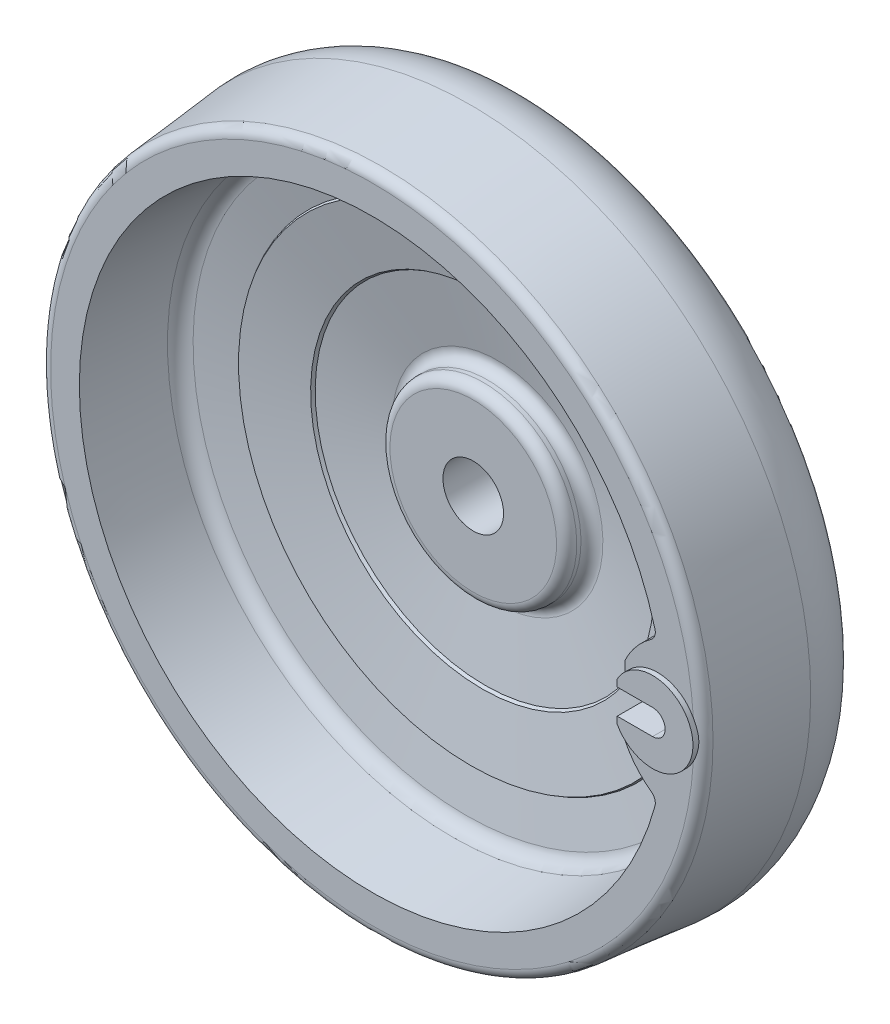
ISO-10303-21;
HEADER;
FILE_DESCRIPTION(('STEP AP214'),'2;1');
FILE_NAME('part.step','',(''),(''),'','','');
FILE_SCHEMA(('AUTOMOTIVE_DESIGN { 1 0 10303 214 1 1 1 1 }'));
ENDSEC;
DATA;
#1=APPLICATION_CONTEXT('core data for automotive mechanical design processes');
#2=APPLICATION_PROTOCOL_DEFINITION('international standard','automotive_design',2000,#1);
#3=PRODUCT_CONTEXT('',#1,'mechanical');
#4=PRODUCT('Part','Part','',(#3));
#5=PRODUCT_RELATED_PRODUCT_CATEGORY('part','',(#4));
#6=PRODUCT_DEFINITION_FORMATION('','',#4);
#7=PRODUCT_DEFINITION_CONTEXT('part definition',#1,'design');
#8=PRODUCT_DEFINITION('design','',#6,#7);
#9=PRODUCT_DEFINITION_SHAPE('','',#8);
#10=(LENGTH_UNIT() NAMED_UNIT(*) SI_UNIT(.MILLI.,.METRE.));
#11=(NAMED_UNIT(*) PLANE_ANGLE_UNIT() SI_UNIT($,.RADIAN.));
#12=(NAMED_UNIT(*) SI_UNIT($,.STERADIAN.) SOLID_ANGLE_UNIT());
#13=UNCERTAINTY_MEASURE_WITH_UNIT(LENGTH_MEASURE(1.E-05),#10,'distance_accuracy_value','');
#14=(GEOMETRIC_REPRESENTATION_CONTEXT(3) GLOBAL_UNCERTAINTY_ASSIGNED_CONTEXT((#13)) GLOBAL_UNIT_ASSIGNED_CONTEXT((#10,
#11,#12)) REPRESENTATION_CONTEXT('',''));
#15=CARTESIAN_POINT('',(0.,0.,0.));
#16=DIRECTION('',(0.,0.,1.));
#17=DIRECTION('',(1.,0.,0.));
#18=AXIS2_PLACEMENT_3D('',#15,#16,#17);
#19=CARTESIAN_POINT('',(64.5,0.,25.));
#20=DIRECTION('',(0.,0.,1.));
#21=DIRECTION('',(0.,-1.,0.));
#22=AXIS2_PLACEMENT_3D('',#19,#20,#21);
#23=CYLINDRICAL_SURFACE('',#22,16.);
#24=CARTESIAN_POINT('',(64.5,0.,45.));
#25=DIRECTION('',(0.,0.,1.));
#26=DIRECTION('',(0.,-1.,0.));
#27=AXIS2_PLACEMENT_3D('',#24,#25,#26);
#28=CIRCLE('',#27,16.);
#29=CARTESIAN_POINT('',(55.2020353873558,13.0210542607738,45.));
#30=VERTEX_POINT('',#29);
#31=CARTESIAN_POINT('',(50.,6.76387462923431,45.));
#32=VERTEX_POINT('',#31);
#33=EDGE_CURVE('E354',#30,#32,#28,.T.);
#34=ORIENTED_EDGE('',*,*,#33,.F.);
#35=CARTESIAN_POINT('',(57.3517508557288,14.3144170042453,72.1994312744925));
#36=CARTESIAN_POINT('',(58.8305950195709,15.0529134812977,72.0312540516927));
#37=CARTESIAN_POINT('',(58.3719672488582,16.6495821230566,72.0004238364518));
#38=CARTESIAN_POINT('',(57.1102243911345,14.1937679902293,69.2142898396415));
#39=CARTESIAN_POINT('',(58.5519265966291,14.9446505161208,69.070354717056));
#40=CARTESIAN_POINT('',(58.1007702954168,16.5120260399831,69.0152824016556));
#41=CARTESIAN_POINT('',(56.8705519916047,14.0664787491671,66.2292937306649));
#42=CARTESIAN_POINT('',(58.2732322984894,14.8276618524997,66.0875009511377));
#43=CARTESIAN_POINT('',(57.8317371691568,16.3667196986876,66.0302862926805));
#44=CARTESIAN_POINT('',(56.3949235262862,13.7979203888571,60.2597170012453));
#45=CARTESIAN_POINT('',(57.7200845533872,14.5766604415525,60.1222585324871));
#46=CARTESIAN_POINT('',(57.2980154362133,16.0597628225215,60.060709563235));
#47=CARTESIAN_POINT('',(56.1589674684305,13.6566512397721,57.2751363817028));
#48=CARTESIAN_POINT('',(57.4455512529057,14.4428792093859,57.1396483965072));
#49=CARTESIAN_POINT('',(57.0333268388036,15.8981122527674,57.0761289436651));
#50=CARTESIAN_POINT('',(55.6908246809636,13.3594619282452,51.3070860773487));
#51=CARTESIAN_POINT('',(56.900787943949,14.1576538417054,51.1756034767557));
#52=CARTESIAN_POINT('',(56.5083612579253,15.5576556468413,51.1080786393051));
#53=CARTESIAN_POINT('',(55.4586372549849,13.2035445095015,48.3236162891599));
#54=CARTESIAN_POINT('',(56.6304839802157,14.0064489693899,48.1940002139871));
#55=CARTESIAN_POINT('',(56.2480834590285,15.378852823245,48.1246088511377));
#56=CARTESIAN_POINT('',(54.9979976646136,12.8760185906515,42.3574025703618));
#57=CARTESIAN_POINT('',(56.0941350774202,13.6853095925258,42.2315475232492));
#58=CARTESIAN_POINT('',(55.7319094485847,15.002846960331,42.158395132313));
#59=CARTESIAN_POINT('',(54.7695454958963,12.7044101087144,39.3746586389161));
#60=CARTESIAN_POINT('',(55.8280216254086,13.5156202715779,39.25056311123));
#61=CARTESIAN_POINT('',(55.4760132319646,14.8056439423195,39.1756512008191));
#62=CARTESIAN_POINT('',(54.3163737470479,12.3441305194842,33.4098999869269));
#63=CARTESIAN_POINT('',(55.3000478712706,13.1560687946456,33.2893310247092));
#64=CARTESIAN_POINT('',(54.9686081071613,14.3912012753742,33.2108925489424));
#65=CARTESIAN_POINT('',(54.0916544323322,12.1554582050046,30.4278853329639));
#66=CARTESIAN_POINT('',(55.0381238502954,12.9664649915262,30.3089823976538));
#67=CARTESIAN_POINT('',(54.7170995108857,14.1739602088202,30.22887789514));
#68=CARTESIAN_POINT('',(53.6459837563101,11.7592228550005,24.4650984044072));
#69=CARTESIAN_POINT('',(54.5185668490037,12.5651267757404,24.3495066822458));
#70=CARTESIAN_POINT('',(54.2185184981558,13.717265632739,24.266090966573));
#71=CARTESIAN_POINT('',(53.4250323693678,11.5516599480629,21.4843261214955));
#72=CARTESIAN_POINT('',(54.2608742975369,12.3536740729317,21.370314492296));
#73=CARTESIAN_POINT('',(53.9714460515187,13.4778122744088,21.2853186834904));
#74=CARTESIAN_POINT('',(53.096429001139,11.2241894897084,17.0141210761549));
#75=CARTESIAN_POINT('',(53.8763285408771,12.0167005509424,16.8882202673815));
#76=CARTESIAN_POINT('',(53.6041693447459,13.0996496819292,16.8151136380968));
#77=CARTESIAN_POINT('',(52.9873550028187,11.1123336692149,15.524071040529));
#78=CARTESIAN_POINT('',(53.7490705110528,11.9016625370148,15.3989816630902));
#79=CARTESIAN_POINT('',(53.4822877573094,12.9704186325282,15.3250636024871));
#80=CARTESIAN_POINT('',(52.7701595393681,10.8828219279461,12.5444496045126));
#81=CARTESIAN_POINT('',(53.4956313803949,11.6649194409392,12.4209635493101));
#82=CARTESIAN_POINT('',(53.2396491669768,12.7051255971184,12.3454421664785));
#83=CARTESIAN_POINT('',(52.6620380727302,10.7651660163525,11.0548782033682));
#84=CARTESIAN_POINT('',(53.36944347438,11.5432562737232,10.9321807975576));
#85=CARTESIAN_POINT('',(53.1188921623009,12.5690636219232,10.8558707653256));
#86=CARTESIAN_POINT('',(52.446750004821,10.5235632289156,8.07625882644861));
#87=CARTESIAN_POINT('',(53.118147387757,11.2927314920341,7.95511981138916));
#88=CARTESIAN_POINT('',(52.8785066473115,12.2895276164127,7.87725138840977));
#89=CARTESIAN_POINT('',(52.3395834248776,10.3996162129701,6.58721086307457));
#90=CARTESIAN_POINT('',(52.993032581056,11.1639146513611,6.4668393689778));
#91=CARTESIAN_POINT('',(52.7588781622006,12.1460534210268,6.38820342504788));
#92=CARTESIAN_POINT('',(52.1262135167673,10.1447961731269,3.60977056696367));
#93=CARTESIAN_POINT('',(52.743892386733,10.8983835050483,3.49091378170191));
#94=CARTESIAN_POINT('',(52.5207603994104,11.8509419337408,3.41076312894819));
#95=CARTESIAN_POINT('',(52.020010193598,10.0139231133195,2.12137823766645));
#96=CARTESIAN_POINT('',(52.6198605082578,10.7617181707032,2.0032674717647));
#97=CARTESIAN_POINT('',(52.4022711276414,11.699304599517,1.92237079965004));
#98=CARTESIAN_POINT('',(51.9142920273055,9.87926894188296,0.633370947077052));
#99=CARTESIAN_POINT('',(52.4959974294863,10.6203333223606,0.511418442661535));
#100=CARTESIAN_POINT('',(52.2843560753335,11.5432095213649,0.434363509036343));
#101=(BOUNDED_SURFACE() B_SPLINE_SURFACE(3,2,((#35,#36,#37),(#38,#39,#40),(#41,#42,#43),(#44,
#45,#46),(#47,#48,#49),(#50,#51,#52),(#53,#54,#55),(#56,#57,#58),(#59,#60,#61),(#62,#63,#64),
(#65,#66,#67),(#68,#69,#70),(#71,#72,#73),(#74,#75,#76),(#77,#78,#79),(#80,#81,#82),(#83,#84,
#85),(#86,#87,#88),(#89,#90,#91),(#92,#93,#94),(#95,#96,#97),(#98,#99,#100)),.UNSPECIFIED.,.F.,
.F.,.F.) B_SPLINE_SURFACE_WITH_KNOTS((4,2,2,2,2,2,2,2,2,2,4),(3,3),(0.,9.00165753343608,
18.003334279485,27.003328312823,36.0033119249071,45.003932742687,54.0044922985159,
58.5056217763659,63.0067441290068,67.5079667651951,72.0092127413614),(0.,1.),
.UNSPECIFIED.) GEOMETRIC_REPRESENTATION_ITEM() RATIONAL_B_SPLINE_SURFACE(((1.,0.769194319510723,
1.),(1.,0.774860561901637,1.),(1.,0.780509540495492,1.),(1.,0.79177880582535,1.),(1.,
0.797399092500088,1.),(1.,0.808615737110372,1.),(1.,0.814212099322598,1.),(1.,0.825387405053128,
1.),(1.,0.830966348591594,1.),(1.,0.842112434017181,1.),(1.,0.847679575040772,1.),(1.,
0.8588065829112,1.),(1.,0.86436644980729,1.),(1.,0.87270479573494,1.),(1.,0.875484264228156,1.),
(1.,0.88104308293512,1.),(1.,0.883822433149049,1.),(1.,0.889381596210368,1.),(1.,
0.892161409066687,1.),(1.,0.897721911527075,1.),(1.,0.900502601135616,1.),(1.,0.903283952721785,1.))) REPRESENTATION_ITEM('') SURFACE());
#102=CARTESIAN_POINT('',(57.3517508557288,14.3144170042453,72.1994312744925));
#103=CARTESIAN_POINT('',(57.1102243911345,14.1937679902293,69.2142898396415));
#104=CARTESIAN_POINT('',(56.8705519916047,14.0664787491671,66.2292937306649));
#105=CARTESIAN_POINT('',(56.3949235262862,13.7979203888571,60.2597170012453));
#106=CARTESIAN_POINT('',(56.1589674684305,13.6566512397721,57.2751363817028));
#107=CARTESIAN_POINT('',(55.6908246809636,13.3594619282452,51.3070860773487));
#108=CARTESIAN_POINT('',(55.4586372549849,13.2035445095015,48.3236162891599));
#109=CARTESIAN_POINT('',(54.9979976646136,12.8760185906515,42.3574025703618));
#110=CARTESIAN_POINT('',(54.7695454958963,12.7044101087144,39.3746586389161));
#111=CARTESIAN_POINT('',(54.3163737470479,12.3441305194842,33.4098999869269));
#112=CARTESIAN_POINT('',(54.0916544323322,12.1554582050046,30.4278853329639));
#113=CARTESIAN_POINT('',(53.6459837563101,11.7592228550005,24.4650984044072));
#114=CARTESIAN_POINT('',(53.4250323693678,11.5516599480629,21.4843261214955));
#115=CARTESIAN_POINT('',(53.096429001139,11.2241894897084,17.0141210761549));
#116=CARTESIAN_POINT('',(52.9873550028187,11.1123336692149,15.524071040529));
#117=CARTESIAN_POINT('',(52.7701595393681,10.8828219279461,12.5444496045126));
#118=CARTESIAN_POINT('',(52.6620380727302,10.7651660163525,11.0548782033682));
#119=CARTESIAN_POINT('',(52.446750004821,10.5235632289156,8.07625882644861));
#120=CARTESIAN_POINT('',(52.3395834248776,10.3996162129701,6.58721086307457));
#121=CARTESIAN_POINT('',(52.1262135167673,10.1447961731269,3.60977056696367));
#122=CARTESIAN_POINT('',(52.020010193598,10.0139231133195,2.12137823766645));
#123=CARTESIAN_POINT('',(51.9142920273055,9.87926894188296,0.633370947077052));
#124=B_SPLINE_CURVE_WITH_KNOTS('',3,(#102,#103,#104,#105,#106,#107,#108,#109,#110,#111,#112,
#113,#114,#115,#116,#117,#118,#119,#120,#121,#122,#123),.UNSPECIFIED.,.F.,.F.,(4,2,2,2,2,2,2,2,
2,2,4),(0.,9.00165753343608,18.003334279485,27.003328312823,36.0033119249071,45.003932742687,
54.0044922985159,58.5056217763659,63.0067441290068,67.5079667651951,72.0092127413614),.UNSPECIFIED.);
#125=CARTESIAN_POINT('',(53.8332598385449,11.925630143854,26.9705231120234));
#126=VERTEX_POINT('',#125);
#127=EDGE_CURVE('E287',#30,#126,#124,.T.);
#128=ORIENTED_EDGE('',*,*,#127,.T.);
#129=CARTESIAN_POINT('',(54.9361157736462,12.8270073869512,29.1373002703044));
#130=CARTESIAN_POINT('',(54.9292385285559,12.8218744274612,29.0584924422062));
#131=CARTESIAN_POINT('',(54.9196176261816,12.8146975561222,28.9800638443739));
#132=CARTESIAN_POINT('',(54.8950532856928,12.7962990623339,28.8245403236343));
#133=CARTESIAN_POINT('',(54.880110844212,12.7850781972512,28.7474451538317));
#134=CARTESIAN_POINT('',(54.8451103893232,12.7586667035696,28.5953288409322));
#135=CARTESIAN_POINT('',(54.8250655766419,12.743486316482,28.5203028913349));
#136=CARTESIAN_POINT('',(54.7800946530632,12.7092186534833,28.3726664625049));
#137=CARTESIAN_POINT('',(54.7551684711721,12.69013132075,28.3000560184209));
#138=CARTESIAN_POINT('',(54.673482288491,12.6271253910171,28.0866225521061));
#139=CARTESIAN_POINT('',(54.6097771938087,12.5774351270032,27.9500371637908));
#140=CARTESIAN_POINT('',(54.4668141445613,12.4636867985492,27.6919494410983));
#141=CARTESIAN_POINT('',(54.3875538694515,12.3996265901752,27.5704493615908));
#142=CARTESIAN_POINT('',(54.2143895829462,12.2563929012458,27.3417161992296));
#143=CARTESIAN_POINT('',(54.1201328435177,12.1768409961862,27.234987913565));
#144=CARTESIAN_POINT('',(53.9225082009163,12.0055721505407,27.0415936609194));
#145=CARTESIAN_POINT('',(53.8191344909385,11.9138474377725,26.9549406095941));
#146=CARTESIAN_POINT('',(53.5974496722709,11.7114848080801,26.7954117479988));
#147=CARTESIAN_POINT('',(53.4786302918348,11.5998884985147,26.7244678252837));
#148=CARTESIAN_POINT('',(53.2387644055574,11.3671640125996,26.6066058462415));
#149=CARTESIAN_POINT('',(53.1177197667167,11.2460435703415,26.5596685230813));
#150=CARTESIAN_POINT('',(52.9511543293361,11.0737821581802,26.5104007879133));
#151=CARTESIAN_POINT('',(52.9051994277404,11.0256631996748,26.4984315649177));
#152=CARTESIAN_POINT('',(52.859411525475,10.9770988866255,26.4880696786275));
#153=B_SPLINE_CURVE_WITH_KNOTS('',3,(#129,#130,#131,#132,#133,#134,#135,#136,#137,#138,#139,
#140,#141,#142,#143,#144,#145,#146,#147,#148,#149,#150,#151,#152),.UNSPECIFIED.,.F.,.F.,(4,2,2,
2,2,2,2,2,2,2,2,4),(0.,0.237736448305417,0.475428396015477,0.712511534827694,0.949598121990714,
1.42327701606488,1.89702662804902,2.38426691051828,2.87181980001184,3.40308707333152,
3.93392729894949,4.13663822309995),.UNSPECIFIED.);
#154=CARTESIAN_POINT('',(52.8602940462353,10.9780346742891,26.4882696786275));
#155=VERTEX_POINT('',#154);
#156=EDGE_CURVE('E240',#126,#155,#153,.T.);
#157=ORIENTED_EDGE('',*,*,#156,.T.);
#158=CARTESIAN_POINT('',(49.999906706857,6.76367462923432,25.817463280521));
#159=CARTESIAN_POINT('',(50.0962775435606,6.97027564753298,25.8408548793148));
#160=CARTESIAN_POINT('',(50.1970088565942,7.17469818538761,25.8652194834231));
#161=CARTESIAN_POINT('',(50.4070039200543,7.57887458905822,25.9158052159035));
#162=CARTESIAN_POINT('',(50.5162675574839,7.7786285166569,25.9420263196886));
#163=CARTESIAN_POINT('',(50.8565919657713,8.37045190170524,26.0233444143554));
#164=CARTESIAN_POINT('',(51.1001744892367,8.75505780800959,26.0810933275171));
#165=CARTESIAN_POINT('',(51.6136695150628,9.49427299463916,26.2016487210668));
#166=CARTESIAN_POINT('',(51.8829891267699,9.84931538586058,26.2643373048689));
#167=CARTESIAN_POINT('',(52.4496428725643,10.5350157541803,26.3948988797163));
#168=CARTESIAN_POINT('',(52.746962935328,10.8656858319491,26.462769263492));
#169=CARTESIAN_POINT('',(53.2983659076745,11.4298929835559,26.5873092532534));
#170=CARTESIAN_POINT('',(53.5473260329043,11.668658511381,26.6431059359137));
#171=CARTESIAN_POINT('',(54.0617848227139,12.1311286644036,26.7574464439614));
#172=CARTESIAN_POINT('',(54.3273945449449,12.3547054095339,26.8160078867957));
#173=CARTESIAN_POINT('',(54.5998830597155,12.5693151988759,26.8755664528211));
#174=B_SPLINE_CURVE_WITH_KNOTS('',3,(#158,#159,#160,#161,#162,#163,#164,#165,#166,#167,#168,
#169,#170,#171,#172,#173),.UNSPECIFIED.,.F.,.F.,(4,2,2,2,2,2,2,4),(0.,0.687392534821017,
1.37477596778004,2.74962627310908,4.09817347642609,5.44604656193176,6.49365729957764,
7.54920891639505),.UNSPECIFIED.);
#175=CARTESIAN_POINT('',(50.,6.76387462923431,25.817485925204));
#176=VERTEX_POINT('',#175);
#177=EDGE_CURVE('E250',#176,#155,#174,.T.);
#178=ORIENTED_EDGE('',*,*,#177,.F.);
#179=DIRECTION('',(0.,0.,1.));
#180=VECTOR('',#179,1.);
#181=CARTESIAN_POINT('',(50.,6.76387462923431,25.));
#182=LINE('',#181,#180);
#183=EDGE_CURVE('E515',#176,#32,#182,.T.);
#184=ORIENTED_EDGE('',*,*,#183,.T.);
#185=EDGE_LOOP('',(#34,#128,#157,#178,#184));
#186=FACE_BOUND('',#185,.T.);
#187=ADVANCED_FACE('F14',(#186),#23,.T.);
#188=CARTESIAN_POINT('',(64.5,0.,25.));
#189=DIRECTION('',(0.,0.,1.));
#190=DIRECTION('',(0.,-1.,0.));
#191=AXIS2_PLACEMENT_3D('',#188,#189,#190);
#192=CYLINDRICAL_SURFACE('',#191,16.);
#193=CARTESIAN_POINT('',(52.859411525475,-10.9770988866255,26.4880696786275));
#194=CARTESIAN_POINT('',(52.9281951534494,-11.0500529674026,26.5036374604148));
#195=CARTESIAN_POINT('',(52.9973149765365,-11.1219641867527,26.5228170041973));
#196=CARTESIAN_POINT('',(53.1357035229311,-11.2633246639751,26.5686879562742));
#197=CARTESIAN_POINT('',(53.2049723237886,-11.3327716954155,26.5953859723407));
#198=CARTESIAN_POINT('',(53.3434872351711,-11.4691653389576,26.6567663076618));
#199=CARTESIAN_POINT('',(53.4127299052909,-11.5360914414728,26.6915023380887));
#200=CARTESIAN_POINT('',(53.5499704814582,-11.666439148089,26.7690260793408));
#201=CARTESIAN_POINT('',(53.6179687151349,-11.729861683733,26.8118116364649));
#202=CARTESIAN_POINT('',(53.7523252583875,-11.8530943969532,26.9057900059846));
#203=CARTESIAN_POINT('',(53.8186717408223,-11.9128814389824,26.957030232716));
#204=CARTESIAN_POINT('',(53.9484064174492,-12.0279420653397,27.0676731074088));
#205=CARTESIAN_POINT('',(54.0117949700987,-12.0832161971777,27.1270747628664));
#206=CARTESIAN_POINT('',(54.134486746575,-12.1886282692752,27.2536298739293));
#207=CARTESIAN_POINT('',(54.1938016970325,-12.2387811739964,27.3207594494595));
#208=CARTESIAN_POINT('',(54.3075842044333,-12.3336997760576,27.4625088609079));
#209=CARTESIAN_POINT('',(54.3620528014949,-12.378466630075,27.5371270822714));
#210=CARTESIAN_POINT('',(54.4582471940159,-12.4565849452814,27.6827413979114));
#211=CARTESIAN_POINT('',(54.5007009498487,-12.4906617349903,27.752869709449));
#212=CARTESIAN_POINT('',(54.5807009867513,-12.5542868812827,27.8978165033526));
#213=CARTESIAN_POINT('',(54.6182479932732,-12.5838359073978,27.9726342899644));
#214=CARTESIAN_POINT('',(54.68790080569,-12.6382223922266,28.1263815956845));
#215=CARTESIAN_POINT('',(54.720007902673,-12.6630609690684,28.2053101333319));
#216=CARTESIAN_POINT('',(54.7783197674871,-12.7078825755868,28.3666139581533));
#217=CARTESIAN_POINT('',(54.8045266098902,-12.7278673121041,28.4489880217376));
#218=CARTESIAN_POINT('',(54.8545462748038,-12.7658293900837,28.6306291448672));
#219=CARTESIAN_POINT('',(54.877212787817,-12.7829019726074,28.7304050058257));
#220=CARTESIAN_POINT('',(54.9135157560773,-12.8101418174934,28.9323429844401));
#221=CARTESIAN_POINT('',(54.9271662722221,-12.8203198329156,29.0345011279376));
#222=CARTESIAN_POINT('',(54.9361157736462,-12.8270073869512,29.1373002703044));
#223=B_SPLINE_CURVE_WITH_KNOTS('',3,(#193,#194,#195,#196,#197,#198,#199,#200,#201,#202,#203,
#204,#205,#206,#207,#208,#209,#210,#211,#212,#213,#214,#215,#216,#217,#218,#219,#220,#221,#222),
.UNSPECIFIED.,.F.,.F.,(4,2,2,2,2,2,2,2,2,2,2,2,2,2,4),(0.,0.30438369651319,0.609035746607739,
0.915785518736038,1.22245333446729,1.53090337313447,1.83931593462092,2.14679983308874,
2.45421757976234,2.72019252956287,2.98612811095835,3.25200048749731,3.51777923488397,
3.82831437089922,4.13836406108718),.UNSPECIFIED.);
#224=CARTESIAN_POINT('',(52.8602940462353,-10.9780346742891,26.4882696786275));
#225=VERTEX_POINT('',#224);
#226=CARTESIAN_POINT('',(53.8332598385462,-11.9256301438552,26.9705231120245));
#227=VERTEX_POINT('',#226);
#228=EDGE_CURVE('E171',#225,#227,#223,.T.);
#229=ORIENTED_EDGE('',*,*,#228,.T.);
#230=CARTESIAN_POINT('',(51.9142920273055,-9.87926894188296,0.633370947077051));
#231=CARTESIAN_POINT('',(52.4959974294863,-10.6203333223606,0.511418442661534));
#232=CARTESIAN_POINT('',(52.2843560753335,-11.5432095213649,0.434363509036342));
#233=CARTESIAN_POINT('',(52.020010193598,-10.0139231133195,2.12137823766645));
#234=CARTESIAN_POINT('',(52.6198605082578,-10.7617181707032,2.0032674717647));
#235=CARTESIAN_POINT('',(52.4022711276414,-11.699304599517,1.92237079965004));
#236=CARTESIAN_POINT('',(52.1262135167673,-10.1447961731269,3.60977056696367));
#237=CARTESIAN_POINT('',(52.743892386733,-10.8983835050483,3.49091378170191));
#238=CARTESIAN_POINT('',(52.5207603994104,-11.8509419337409,3.41076312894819));
#239=CARTESIAN_POINT('',(52.3395834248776,-10.3996162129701,6.58721086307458));
#240=CARTESIAN_POINT('',(52.993032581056,-11.1639146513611,6.46683936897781));
#241=CARTESIAN_POINT('',(52.7588781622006,-12.1460534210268,6.38820342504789));
#242=CARTESIAN_POINT('',(52.446750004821,-10.5235632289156,8.07625882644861));
#243=CARTESIAN_POINT('',(53.118147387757,-11.2927314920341,7.95511981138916));
#244=CARTESIAN_POINT('',(52.8785066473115,-12.2895276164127,7.87725138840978));
#245=CARTESIAN_POINT('',(52.6620380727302,-10.7651660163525,11.0548782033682));
#246=CARTESIAN_POINT('',(53.36944347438,-11.5432562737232,10.9321807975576));
#247=CARTESIAN_POINT('',(53.1188921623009,-12.5690636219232,10.8558707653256));
#248=CARTESIAN_POINT('',(52.7701595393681,-10.8828219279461,12.5444496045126));
#249=CARTESIAN_POINT('',(53.4956313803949,-11.6649194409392,12.4209635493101));
#250=CARTESIAN_POINT('',(53.2396491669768,-12.7051255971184,12.3454421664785));
#251=CARTESIAN_POINT('',(52.9873550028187,-11.1123336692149,15.524071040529));
#252=CARTESIAN_POINT('',(53.7490705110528,-11.9016625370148,15.3989816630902));
#253=CARTESIAN_POINT('',(53.4822877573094,-12.9704186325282,15.3250636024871));
#254=CARTESIAN_POINT('',(53.096429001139,-11.2241894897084,17.0141210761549));
#255=CARTESIAN_POINT('',(53.8763285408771,-12.0167005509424,16.8882202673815));
#256=CARTESIAN_POINT('',(53.6041693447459,-13.0996496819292,16.8151136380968));
#257=CARTESIAN_POINT('',(53.4250323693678,-11.5516599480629,21.4843261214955));
#258=CARTESIAN_POINT('',(54.2608742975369,-12.3536740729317,21.370314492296));
#259=CARTESIAN_POINT('',(53.9714460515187,-13.4778122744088,21.2853186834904));
#260=CARTESIAN_POINT('',(53.6459837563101,-11.7592228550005,24.4650984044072));
#261=CARTESIAN_POINT('',(54.5185668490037,-12.5651267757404,24.3495066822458));
#262=CARTESIAN_POINT('',(54.2185184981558,-13.717265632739,24.266090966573));
#263=CARTESIAN_POINT('',(54.0916544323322,-12.1554582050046,30.4278853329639));
#264=CARTESIAN_POINT('',(55.0381238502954,-12.9664649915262,30.3089823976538));
#265=CARTESIAN_POINT('',(54.7170995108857,-14.1739602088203,30.22887789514));
#266=CARTESIAN_POINT('',(54.3163737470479,-12.3441305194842,33.4098999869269));
#267=CARTESIAN_POINT('',(55.3000478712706,-13.1560687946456,33.2893310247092));
#268=CARTESIAN_POINT('',(54.9686081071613,-14.3912012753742,33.2108925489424));
#269=CARTESIAN_POINT('',(54.7695454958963,-12.7044101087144,39.3746586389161));
#270=CARTESIAN_POINT('',(55.8280216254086,-13.5156202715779,39.25056311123));
#271=CARTESIAN_POINT('',(55.4760132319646,-14.8056439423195,39.1756512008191));
#272=CARTESIAN_POINT('',(54.9979976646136,-12.8760185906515,42.3574025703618));
#273=CARTESIAN_POINT('',(56.0941350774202,-13.6853095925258,42.2315475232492));
#274=CARTESIAN_POINT('',(55.7319094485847,-15.0028469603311,42.158395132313));
#275=CARTESIAN_POINT('',(55.4586372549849,-13.2035445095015,48.3236162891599));
#276=CARTESIAN_POINT('',(56.6304839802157,-14.0064489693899,48.1940002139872));
#277=CARTESIAN_POINT('',(56.2480834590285,-15.378852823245,48.1246088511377));
#278=CARTESIAN_POINT('',(55.6908246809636,-13.3594619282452,51.3070860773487));
#279=CARTESIAN_POINT('',(56.900787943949,-14.1576538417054,51.1756034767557));
#280=CARTESIAN_POINT('',(56.5083612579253,-15.5576556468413,51.1080786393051));
#281=CARTESIAN_POINT('',(56.1589674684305,-13.6566512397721,57.2751363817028));
#282=CARTESIAN_POINT('',(57.4455512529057,-14.4428792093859,57.1396483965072));
#283=CARTESIAN_POINT('',(57.0333268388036,-15.8981122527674,57.0761289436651));
#284=CARTESIAN_POINT('',(56.3949235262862,-13.7979203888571,60.2597170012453));
#285=CARTESIAN_POINT('',(57.7200845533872,-14.5766604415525,60.1222585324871));
#286=CARTESIAN_POINT('',(57.2980154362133,-16.0597628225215,60.060709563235));
#287=CARTESIAN_POINT('',(56.8705519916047,-14.0664787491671,66.2292937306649));
#288=CARTESIAN_POINT('',(58.2732322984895,-14.8276618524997,66.0875009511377));
#289=CARTESIAN_POINT('',(57.8317371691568,-16.3667196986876,66.0302862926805));
#290=CARTESIAN_POINT('',(57.1102243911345,-14.1937679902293,69.2142898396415));
#291=CARTESIAN_POINT('',(58.5519265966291,-14.9446505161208,69.070354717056));
#292=CARTESIAN_POINT('',(58.1007702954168,-16.5120260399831,69.0152824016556));
#293=CARTESIAN_POINT('',(57.3517508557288,-14.3144170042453,72.1994312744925));
#294=CARTESIAN_POINT('',(58.8305950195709,-15.0529134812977,72.0312540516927));
#295=CARTESIAN_POINT('',(58.3719672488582,-16.6495821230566,72.0004238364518));
#296=(BOUNDED_SURFACE() B_SPLINE_SURFACE(3,2,((#230,#231,#232),(#233,#234,#235),(#236,#237,
#238),(#239,#240,#241),(#242,#243,#244),(#245,#246,#247),(#248,#249,#250),(#251,#252,#253),
(#254,#255,#256),(#257,#258,#259),(#260,#261,#262),(#263,#264,#265),(#266,#267,#268),(#269,#270,
#271),(#272,#273,#274),(#275,#276,#277),(#278,#279,#280),(#281,#282,#283),(#284,#285,#286),
(#287,#288,#289),(#290,#291,#292),(#293,#294,#295)),.UNSPECIFIED.,.F.,.F.,
.F.) B_SPLINE_SURFACE_WITH_KNOTS((4,2,2,2,2,2,2,2,2,2,4),(3,3),(0.,4.50124597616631,
9.00246861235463,13.5035909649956,18.0047204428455,27.0052799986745,36.0059008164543,
45.0058844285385,54.0058784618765,63.0075552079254,72.0092127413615),(0.,1.),
.UNSPECIFIED.) GEOMETRIC_REPRESENTATION_ITEM() RATIONAL_B_SPLINE_SURFACE(((1.,0.903283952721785,
1.),(1.,0.900502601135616,1.),(1.,0.897721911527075,1.),(1.,0.892161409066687,1.),(1.,
0.889381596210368,1.),(1.,0.883822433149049,1.),(1.,0.88104308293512,1.),(1.,0.875484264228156,
1.),(1.,0.872704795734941,1.),(1.,0.864366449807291,1.),(1.,0.858806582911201,1.),(1.,
0.847679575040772,1.),(1.,0.84211243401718,1.),(1.,0.830966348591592,1.),(1.,0.825387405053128,
1.),(1.,0.814212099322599,1.),(1.,0.808615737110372,1.),(1.,0.797399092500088,1.),(1.,
0.79177880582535,1.),(1.,0.780509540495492,1.),(1.,0.774860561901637,1.),(1.,0.769194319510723,1.))) REPRESENTATION_ITEM('') SURFACE());
#297=CARTESIAN_POINT('',(51.9142920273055,-9.87926894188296,0.633370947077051));
#298=CARTESIAN_POINT('',(52.020010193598,-10.0139231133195,2.12137823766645));
#299=CARTESIAN_POINT('',(52.1262135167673,-10.1447961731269,3.60977056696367));
#300=CARTESIAN_POINT('',(52.3395834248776,-10.3996162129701,6.58721086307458));
#301=CARTESIAN_POINT('',(52.446750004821,-10.5235632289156,8.07625882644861));
#302=CARTESIAN_POINT('',(52.6620380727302,-10.7651660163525,11.0548782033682));
#303=CARTESIAN_POINT('',(52.7701595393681,-10.8828219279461,12.5444496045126));
#304=CARTESIAN_POINT('',(52.9873550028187,-11.1123336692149,15.524071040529));
#305=CARTESIAN_POINT('',(53.096429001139,-11.2241894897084,17.0141210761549));
#306=CARTESIAN_POINT('',(53.4250323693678,-11.5516599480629,21.4843261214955));
#307=CARTESIAN_POINT('',(53.6459837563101,-11.7592228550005,24.4650984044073));
#308=CARTESIAN_POINT('',(54.0916544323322,-12.1554582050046,30.4278853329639));
#309=CARTESIAN_POINT('',(54.3163737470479,-12.3441305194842,33.4098999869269));
#310=CARTESIAN_POINT('',(54.7695454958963,-12.7044101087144,39.3746586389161));
#311=CARTESIAN_POINT('',(54.9979976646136,-12.8760185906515,42.3574025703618));
#312=CARTESIAN_POINT('',(55.4586372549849,-13.2035445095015,48.3236162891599));
#313=CARTESIAN_POINT('',(55.6908246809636,-13.3594619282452,51.3070860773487));
#314=CARTESIAN_POINT('',(56.1589674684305,-13.6566512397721,57.2751363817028));
#315=CARTESIAN_POINT('',(56.3949235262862,-13.7979203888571,60.2597170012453));
#316=CARTESIAN_POINT('',(56.8705519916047,-14.0664787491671,66.2292937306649));
#317=CARTESIAN_POINT('',(57.1102243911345,-14.1937679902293,69.2142898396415));
#318=CARTESIAN_POINT('',(57.3517508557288,-14.3144170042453,72.1994312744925));
#319=B_SPLINE_CURVE_WITH_KNOTS('',3,(#297,#298,#299,#300,#301,#302,#303,#304,#305,#306,#307,
#308,#309,#310,#311,#312,#313,#314,#315,#316,#317,#318),.UNSPECIFIED.,.F.,.F.,(4,2,2,2,2,2,2,2,
2,2,4),(0.,4.50124597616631,9.00246861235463,13.5035909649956,18.0047204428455,27.0052799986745,
36.0059008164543,45.0058844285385,54.0058784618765,63.0075552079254,72.0092127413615),.UNSPECIFIED.);
#320=CARTESIAN_POINT('',(55.2020353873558,-13.0210542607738,45.));
#321=VERTEX_POINT('',#320);
#322=EDGE_CURVE('E175',#227,#321,#319,.T.);
#323=ORIENTED_EDGE('',*,*,#322,.T.);
#324=CARTESIAN_POINT('',(64.5,0.,45.));
#325=DIRECTION('',(0.,0.,1.));
#326=DIRECTION('',(0.,-1.,0.));
#327=AXIS2_PLACEMENT_3D('',#324,#325,#326);
#328=CIRCLE('',#327,16.);
#329=CARTESIAN_POINT('',(50.,-6.76387462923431,45.));
#330=VERTEX_POINT('',#329);
#331=EDGE_CURVE('E521',#330,#321,#328,.T.);
#332=ORIENTED_EDGE('',*,*,#331,.F.);
#333=DIRECTION('',(0.,0.,1.));
#334=VECTOR('',#333,1.);
#335=CARTESIAN_POINT('',(50.,-6.76387462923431,25.));
#336=LINE('',#335,#334);
#337=CARTESIAN_POINT('',(50.,-6.76387462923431,25.817485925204));
#338=VERTEX_POINT('',#337);
#339=EDGE_CURVE('E512',#338,#330,#336,.T.);
#340=ORIENTED_EDGE('',*,*,#339,.F.);
#341=CARTESIAN_POINT('',(54.5998830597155,-12.5693151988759,26.8755664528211));
#342=CARTESIAN_POINT('',(54.2450404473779,-12.2898847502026,26.7980130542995));
#343=CARTESIAN_POINT('',(53.9018449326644,-11.99516922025,26.7221383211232));
#344=CARTESIAN_POINT('',(53.2409590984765,-11.3771003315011,26.5745211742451));
#345=CARTESIAN_POINT('',(52.9232831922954,-11.0537310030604,26.5027811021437));
#346=CARTESIAN_POINT('',(52.3219338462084,-10.3871262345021,26.3656387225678));
#347=CARTESIAN_POINT('',(52.037720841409,-10.0443971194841,26.3001405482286));
#348=CARTESIAN_POINT('',(51.4985521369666,-9.33596939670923,26.1747659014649));
#349=CARTESIAN_POINT('',(51.243579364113,-8.97028438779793,26.1148861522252));
#350=CARTESIAN_POINT('',(50.8180469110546,-8.3020599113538,26.0141303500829));
#351=CARTESIAN_POINT('',(50.6413373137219,-8.00360591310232,25.9719928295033));
#352=CARTESIAN_POINT('',(50.3061806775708,-7.39309054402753,25.8916021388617));
#353=CARTESIAN_POINT('',(50.1478838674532,-7.08094246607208,25.8533811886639));
#354=CARTESIAN_POINT('',(49.999906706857,-6.7636746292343,25.817463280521));
#355=B_SPLINE_CURVE_WITH_KNOTS('',3,(#341,#342,#343,#344,#345,#346,#347,#348,#349,#350,#351,
#352,#353,#354),.UNSPECIFIED.,.F.,.F.,(4,2,2,2,2,2,4),(0.,1.37443240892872,2.74963570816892,
4.09819319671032,5.44595921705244,6.49341932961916,7.54890143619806),.UNSPECIFIED.);
#356=EDGE_CURVE('E323',#225,#338,#355,.T.);
#357=ORIENTED_EDGE('',*,*,#356,.F.);
#358=EDGE_LOOP('',(#229,#323,#332,#340,#357));
#359=FACE_BOUND('',#358,.T.);
#360=ADVANCED_FACE('F221',(#359),#192,.T.);
#361=CARTESIAN_POINT('',(56.5,0.,46.));
#362=DIRECTION('',(0.,0.,1.));
#363=DIRECTION('',(0.,-1.,0.));
#364=AXIS2_PLACEMENT_3D('',#361,#362,#363);
#365=PLANE('',#364);
#366=CARTESIAN_POINT('',(56.5,0.,46.));
#367=DIRECTION('',(0.,0.,1.));
#368=DIRECTION('',(0.,-1.,0.));
#369=AXIS2_PLACEMENT_3D('',#366,#367,#368);
#370=CIRCLE('',#369,8.);
#371=CARTESIAN_POINT('',(49.5,-3.87298334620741,46.));
#372=VERTEX_POINT('',#371);
#373=CARTESIAN_POINT('',(49.5,3.8729833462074,46.));
#374=VERTEX_POINT('',#373);
#375=EDGE_CURVE('E430',#372,#374,#370,.T.);
#376=ORIENTED_EDGE('',*,*,#375,.T.);
#377=DIRECTION('',(0.,-1.,0.));
#378=VECTOR('',#377,1.);
#379=CARTESIAN_POINT('',(49.5,3.8729833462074,46.));
#380=LINE('',#379,#378);
#381=CARTESIAN_POINT('',(49.5,2.49999999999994,46.));
#382=VERTEX_POINT('',#381);
#383=EDGE_CURVE('E433',#374,#382,#380,.T.);
#384=ORIENTED_EDGE('',*,*,#383,.T.);
#385=DIRECTION('',(1.,0.,0.));
#386=VECTOR('',#385,1.);
#387=CARTESIAN_POINT('',(49.5,2.49999999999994,46.));
#388=LINE('',#387,#386);
#389=CARTESIAN_POINT('',(56.5,2.49999999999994,46.));
#390=VERTEX_POINT('',#389);
#391=EDGE_CURVE('E537',#382,#390,#388,.T.);
#392=ORIENTED_EDGE('',*,*,#391,.T.);
#393=CARTESIAN_POINT('',(56.5,0.,46.));
#394=DIRECTION('',(0.,0.,1.));
#395=DIRECTION('',(0.,-1.,0.));
#396=AXIS2_PLACEMENT_3D('',#393,#394,#395);
#397=CIRCLE('',#396,2.49999999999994);
#398=CARTESIAN_POINT('',(56.5,-2.49999999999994,46.));
#399=VERTEX_POINT('',#398);
#400=EDGE_CURVE('E546',#399,#390,#397,.T.);
#401=ORIENTED_EDGE('',*,*,#400,.F.);
#402=DIRECTION('',(1.,0.,0.));
#403=VECTOR('',#402,1.);
#404=CARTESIAN_POINT('',(49.5,-2.49999999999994,46.));
#405=LINE('',#404,#403);
#406=CARTESIAN_POINT('',(49.5,-2.49999999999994,46.));
#407=VERTEX_POINT('',#406);
#408=EDGE_CURVE('E545',#407,#399,#405,.T.);
#409=ORIENTED_EDGE('',*,*,#408,.F.);
#410=EDGE_CURVE('E432',#407,#372,#380,.T.);
#411=ORIENTED_EDGE('',*,*,#410,.T.);
#412=EDGE_LOOP('',(#376,#384,#392,#401,#409,#411));
#413=FACE_BOUND('',#412,.T.);
#414=ADVANCED_FACE('F227',(#413),#365,.T.);
#415=CARTESIAN_POINT('',(-65.6900248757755,0.,45.));
#416=DIRECTION('',(0.,0.,-1.));
#417=DIRECTION('',(0.,1.,0.));
#418=AXIS2_PLACEMENT_3D('',#415,#416,#417);
#419=PLANE('',#418);
#420=CARTESIAN_POINT('',(56.5,0.,45.));
#421=DIRECTION('',(0.,0.,-1.));
#422=DIRECTION('',(0.,1.,0.));
#423=AXIS2_PLACEMENT_3D('',#420,#421,#422);
#424=CIRCLE('',#423,8.);
#425=CARTESIAN_POINT('',(63.5802142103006,-3.72534533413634,45.0000002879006));
#426=VERTEX_POINT('',#425);
#427=CARTESIAN_POINT('',(50.,-4.6636895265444,45.));
#428=VERTEX_POINT('',#427);
#429=EDGE_CURVE('E157',#426,#428,#424,.T.);
#430=ORIENTED_EDGE('',*,*,#429,.T.);
#431=DIRECTION('',(0.,-1.,0.));
#432=VECTOR('',#431,1.);
#433=CARTESIAN_POINT('',(50.,6.76387462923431,45.));
#434=LINE('',#433,#432);
#435=EDGE_CURVE('E525',#428,#330,#434,.T.);
#436=ORIENTED_EDGE('',*,*,#435,.T.);
#437=ORIENTED_EDGE('',*,*,#331,.T.);
#438=CARTESIAN_POINT('',(55.2020353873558,-13.0210542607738,45.));
#439=CARTESIAN_POINT('',(55.2482770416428,-13.0540749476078,45.));
#440=CARTESIAN_POINT('',(55.2931050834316,-13.0890285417,45.));
#441=CARTESIAN_POINT('',(55.3796623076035,-13.1625793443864,45.));
#442=CARTESIAN_POINT('',(55.421391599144,-13.201176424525,45.));
#443=CARTESIAN_POINT('',(55.5414154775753,-13.3219893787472,45.));
#444=CARTESIAN_POINT('',(55.6146782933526,-13.4093215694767,45.));
#445=CARTESIAN_POINT('',(55.7454913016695,-13.5950464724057,45.));
#446=CARTESIAN_POINT('',(55.8030343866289,-13.6934441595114,45.));
#447=CARTESIAN_POINT('',(55.9007399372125,-13.8985268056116,45.));
#448=CARTESIAN_POINT('',(55.9409046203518,-14.0052107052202,45.));
#449=CARTESIAN_POINT('',(56.0025844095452,-14.2235687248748,45.));
#450=CARTESIAN_POINT('',(56.0241409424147,-14.3352311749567,45.));
#451=CARTESIAN_POINT('',(56.0480715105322,-14.5605798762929,45.));
#452=CARTESIAN_POINT('',(56.0504566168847,-14.6742649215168,45.));
#453=CARTESIAN_POINT('',(56.0389485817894,-14.8539775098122,45.));
#454=CARTESIAN_POINT('',(56.0313187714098,-14.9204653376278,45.));
#455=CARTESIAN_POINT('',(56.0094552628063,-15.052225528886,45.));
#456=CARTESIAN_POINT('',(55.9952332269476,-15.1174998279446,45.));
#457=CARTESIAN_POINT('',(55.9777558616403,-15.1819250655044,45.));
#458=B_SPLINE_CURVE_WITH_KNOTS('',3,(#438,#439,#440,#441,#442,#443,#444,#445,#446,#447,#448,
#449,#450,#451,#452,#453,#454,#455,#456,#457),.UNSPECIFIED.,.F.,.F.,(4,2,2,2,2,2,2,2,2,4),(0.,
0.170359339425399,0.340712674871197,0.680937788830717,1.02131647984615,1.36165172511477,
1.70122732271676,2.04060680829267,2.24107323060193,2.4411863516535),.UNSPECIFIED.);
#459=CARTESIAN_POINT('',(55.9777558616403,-15.1819250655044,45.));
#460=VERTEX_POINT('',#459);
#461=EDGE_CURVE('E27',#321,#460,#458,.T.);
#462=ORIENTED_EDGE('',*,*,#461,.T.);
#463=CARTESIAN_POINT('',(0.,0.,45.));
#464=DIRECTION('',(0.,0.,1.));
#465=DIRECTION('',(1.,0.,0.));
#466=AXIS2_PLACEMENT_3D('',#463,#464,#465);
#467=CIRCLE('',#466,58.);
#468=CARTESIAN_POINT('',(55.9777558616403,15.1819250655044,45.));
#469=VERTEX_POINT('',#468);
#470=EDGE_CURVE('E563',#469,#460,#467,.T.);
#471=ORIENTED_EDGE('',*,*,#470,.F.);
#472=CARTESIAN_POINT('',(55.9777558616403,15.1819250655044,45.));
#473=CARTESIAN_POINT('',(55.9924874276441,15.1276069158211,45.));
#474=CARTESIAN_POINT('',(56.004909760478,15.0726908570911,45.));
#475=CARTESIAN_POINT('',(56.0250730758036,14.9620100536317,45.));
#476=CARTESIAN_POINT('',(56.0328143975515,14.9062453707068,45.));
#477=CARTESIAN_POINT('',(56.0489061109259,14.7383865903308,45.));
#478=CARTESIAN_POINT('',(56.0501771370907,14.6255318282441,45.));
#479=CARTESIAN_POINT('',(56.0337794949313,14.4012368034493,45.));
#480=CARTESIAN_POINT('',(56.0161055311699,14.2897969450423,45.));
#481=CARTESIAN_POINT('',(55.9623752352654,14.0714297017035,45.));
#482=CARTESIAN_POINT('',(55.9263194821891,13.9645021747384,45.));
#483=CARTESIAN_POINT('',(55.8367049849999,13.7577345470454,45.));
#484=CARTESIAN_POINT('',(55.7830732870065,13.6579261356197,45.));
#485=CARTESIAN_POINT('',(55.6598853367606,13.4686852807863,45.));
#486=CARTESIAN_POINT('',(55.5903361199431,13.3792482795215,45.));
#487=CARTESIAN_POINT('',(55.4667632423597,13.2451597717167,45.));
#488=CARTESIAN_POINT('',(55.4170216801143,13.1964913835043,45.));
#489=CARTESIAN_POINT('',(55.312895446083,13.1046072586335,45.));
#490=CARTESIAN_POINT('',(55.258519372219,13.0613817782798,45.));
#491=CARTESIAN_POINT('',(55.2020353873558,13.0210542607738,45.));
#492=B_SPLINE_CURVE_WITH_KNOTS('',3,(#472,#473,#474,#475,#476,#477,#478,#479,#480,#481,#482,
#483,#484,#485,#486,#487,#488,#489,#490,#491),.UNSPECIFIED.,.F.,.F.,(4,2,2,2,2,2,2,2,2,4),(0.,
0.168736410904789,0.337460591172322,0.674307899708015,1.01124938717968,1.34818026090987,
1.68652775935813,2.02472599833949,2.23315915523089,2.44121371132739),.UNSPECIFIED.);
#493=EDGE_CURVE('E9',#469,#30,#492,.T.);
#494=ORIENTED_EDGE('',*,*,#493,.T.);
#495=ORIENTED_EDGE('',*,*,#33,.T.);
#496=CARTESIAN_POINT('',(50.,4.6636895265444,45.));
#497=VERTEX_POINT('',#496);
#498=EDGE_CURVE('E152',#32,#497,#434,.T.);
#499=ORIENTED_EDGE('',*,*,#498,.T.);
#500=CARTESIAN_POINT('',(63.5809004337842,3.72404056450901,44.9999997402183));
#501=VERTEX_POINT('',#500);
#502=EDGE_CURVE('E145',#497,#501,#424,.T.);
#503=ORIENTED_EDGE('',*,*,#502,.T.);
#504=CARTESIAN_POINT('',(63.5784294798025,3.72771191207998,45.));
#505=CARTESIAN_POINT('',(63.2181912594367,9.87179730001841,45.));
#506=CARTESIAN_POINT('',(61.6879171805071,15.83393208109,45.));
#507=CARTESIAN_POINT('',(60.1579219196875,21.7949805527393,45.));
#508=CARTESIAN_POINT('',(57.5140631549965,27.3540686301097,45.));
#509=CARTESIAN_POINT('',(54.8708486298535,32.9118021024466,45.));
#510=CARTESIAN_POINT('',(51.2113601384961,37.8617105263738,45.));
#511=CARTESIAN_POINT('',(47.5527633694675,42.8104127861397,45.));
#512=CARTESIAN_POINT('',(43.0130989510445,46.967923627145,45.));
#513=CARTESIAN_POINT('',(38.4745407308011,51.124421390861,45.));
#514=CARTESIAN_POINT('',(33.2227333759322,54.3356468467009,45.));
#515=CARTESIAN_POINT('',(27.9722057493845,57.5460898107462,45.));
#516=CARTESIAN_POINT('',(22.202647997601,59.6921682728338,45.));
#517=CARTESIAN_POINT('',(16.4344961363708,61.8377237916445,45.));
#518=CARTESIAN_POINT('',(10.3607447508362,62.8392194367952,45.));
#519=CARTESIAN_POINT('',(4.28847338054,63.8404710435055,45.));
#520=CARTESIAN_POINT('',(-1.86465532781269,63.6603141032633,45.));
#521=CARTESIAN_POINT('',(-8.01628467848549,63.4802010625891,45.));
#522=CARTESIAN_POINT('',(-14.0210362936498,62.1250599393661,45.));
#523=CARTESIAN_POINT('',(-20.0243247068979,60.7702490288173,45.));
#524=CARTESIAN_POINT('',(-25.6584369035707,58.2902834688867,45.));
#525=CARTESIAN_POINT('',(-31.2912917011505,55.8108713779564,45.));
#526=CARTESIAN_POINT('',(-36.3461056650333,52.2979266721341,45.));
#527=CARTESIAN_POINT('',(-41.3999948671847,48.7856246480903,45.));
#528=CARTESIAN_POINT('',(-45.6884448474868,44.3697930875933,45.));
#529=CARTESIAN_POINT('',(-49.9761981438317,39.9546789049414,45.));
#530=CARTESIAN_POINT('',(-53.3396532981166,34.7993378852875,45.));
#531=CARTESIAN_POINT('',(-56.7025620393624,29.6448343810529,45.));
#532=CARTESIAN_POINT('',(-59.016526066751,23.9408057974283,45.));
#533=CARTESIAN_POINT('',(-61.3301141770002,18.237703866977,45.));
#534=CARTESIAN_POINT('',(-62.5089370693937,12.1961189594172,45.));
#535=CARTESIAN_POINT('',(-63.6875684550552,6.1555155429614,45.));
#536=CARTESIAN_POINT('',(-63.6876167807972,0.,45.));
#537=CARTESIAN_POINT('',(-63.6876650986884,-6.15451554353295,45.));
#538=CARTESIAN_POINT('',(-62.5089370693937,-12.1961189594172,45.));
#539=CARTESIAN_POINT('',(-61.3304005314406,-18.2367408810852,45.));
#540=CARTESIAN_POINT('',(-59.016526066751,-23.9408057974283,45.));
#541=CARTESIAN_POINT('',(-56.7030275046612,-29.6439440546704,45.));
#542=CARTESIAN_POINT('',(-53.3396532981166,-34.7993378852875,45.));
#543=CARTESIAN_POINT('',(-49.9768254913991,-39.953894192,45.));
#544=CARTESIAN_POINT('',(-45.6884448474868,-44.3697930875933,45.));
#545=CARTESIAN_POINT('',(-41.4008487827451,-48.7848840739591,45.));
#546=CARTESIAN_POINT('',(-36.3461056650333,-52.2979266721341,45.));
#547=CARTESIAN_POINT('',(-31.292490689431,-55.8101852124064,45.));
#548=CARTESIAN_POINT('',(-25.6584369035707,-58.2902834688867,45.));
#549=CARTESIAN_POINT('',(-20.0257559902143,-60.7697773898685,45.));
#550=CARTESIAN_POINT('',(-14.0210362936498,-62.1250599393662,45.));
#551=CARTESIAN_POINT('',(-8.01777979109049,-63.4800122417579,45.));
#552=CARTESIAN_POINT('',(-1.86465532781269,-63.6603141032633,45.));
#553=CARTESIAN_POINT('',(4.2869697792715,-63.8405720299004,45.));
#554=CARTESIAN_POINT('',(10.3607447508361,-62.8392194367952,45.));
#555=CARTESIAN_POINT('',(16.4330397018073,-61.8381108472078,45.));
#556=CARTESIAN_POINT('',(22.202647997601,-59.6921682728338,45.));
#557=CARTESIAN_POINT('',(27.9708503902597,-57.546748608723,45.));
#558=CARTESIAN_POINT('',(33.2227333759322,-54.335646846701,45.));
#559=CARTESIAN_POINT('',(38.4733366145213,-51.125327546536,45.));
#560=CARTESIAN_POINT('',(43.0130989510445,-46.967923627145,45.));
#561=CARTESIAN_POINT('',(47.5517550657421,-42.8115327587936,45.));
#562=CARTESIAN_POINT('',(51.2113601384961,-37.8617105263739,45.));
#563=CARTESIAN_POINT('',(54.8700734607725,-32.9130944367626,45.));
#564=CARTESIAN_POINT('',(57.5140631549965,-27.3540686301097,45.));
#565=CARTESIAN_POINT('',(60.1574085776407,-21.7963974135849,45.));
#566=CARTESIAN_POINT('',(61.6879171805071,-15.83393208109,45.));
#567=CARTESIAN_POINT('',(63.2181469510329,-9.87255300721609,45.));
#568=CARTESIAN_POINT('',(63.5784294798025,-3.72771191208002,45.));
#569=B_SPLINE_CURVE_WITH_KNOTS('',2,(#504,#505,#506,#507,#508,#509,#510,#511,#512,#513,#514,
#515,#516,#517,#518,#519,#520,#521,#522,#523,#524,#525,#526,#527,#528,#529,#530,#531,#532,#533,
#534,#535,#536,#537,#538,#539,#540,#541,#542,#543,#544,#545,#546,#547,#548,#549,#550,#551,#552,
#553,#554,#555,#556,#557,#558,#559,#560,#561,#562,#563,#564,#565,#566,#567,#568),.UNSPECIFIED.,
.F.,.F.,(3,2,2,2,2,2,2,2,2,2,2,2,2,2,2,2,2,2,2,2,2,2,2,2,2,2,2,2,2,2,2,2,3),(0.,0.03125,0.0625,
0.09375,0.125,0.15625,0.1875,0.21875,0.25,0.28125,0.3125,0.34375,0.375,0.40625,0.4375,0.46875,
0.5,0.53125,0.5625,0.59375,0.625,0.65625,0.6875,0.71875,0.75,0.78125,0.8125,0.84375,0.875,
0.90625,0.9375,0.96875,1.),.UNSPECIFIED.);
#570=EDGE_CURVE('E148',#501,#426,#569,.T.);
#571=ORIENTED_EDGE('',*,*,#570,.T.);
#572=EDGE_LOOP('',(#430,#436,#437,#462,#471,#494,#495,#499,#503,#571));
#573=FACE_BOUND('',#572,.T.);
#574=ADVANCED_FACE('F147',(#573),#419,.F.);
#575=CARTESIAN_POINT('',(-65.497907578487,0.,16.));
#576=DIRECTION('',(0.,0.,-1.));
#577=DIRECTION('',(0.,1.,0.));
#578=AXIS2_PLACEMENT_3D('',#575,#576,#577);
#579=PLANE('',#578);
#580=CARTESIAN_POINT('',(0.,0.,16.));
#581=DIRECTION('',(0.,0.,1.));
#582=DIRECTION('',(0.,-1.,0.));
#583=AXIS2_PLACEMENT_3D('',#580,#581,#582);
#584=CIRCLE('',#583,26.6323529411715);
#585=CARTESIAN_POINT('',(0.,-26.6323529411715,16.));
#586=VERTEX_POINT('',#585);
#587=EDGE_CURVE('E490',#586,#586,#584,.T.);
#588=ORIENTED_EDGE('',*,*,#587,.T.);
#589=EDGE_LOOP('',(#588));
#590=FACE_BOUND('',#589,.T.);
#591=CARTESIAN_POINT('',(0.,0.,16.));
#592=DIRECTION('',(0.,0.,1.));
#593=DIRECTION('',(1.,0.,0.));
#594=AXIS2_PLACEMENT_3D('',#591,#592,#593);
#595=CIRCLE('',#594,63.497907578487);
#596=CARTESIAN_POINT('',(63.497907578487,0.,16.));
#597=VERTEX_POINT('',#596);
#598=EDGE_CURVE('E164',#597,#597,#595,.T.);
#599=ORIENTED_EDGE('',*,*,#598,.F.);
#600=EDGE_LOOP('',(#599));
#601=FACE_BOUND('',#600,.T.);
#602=ADVANCED_FACE('F309',(#590,#601),#579,.T.);
#603=CARTESIAN_POINT('',(56.5,0.,25.));
#604=DIRECTION('',(0.,0.,1.));
#605=DIRECTION('',(0.,-1.,0.));
#606=AXIS2_PLACEMENT_3D('',#603,#604,#605);
#607=CYLINDRICAL_SURFACE('',#606,8.);
#608=DIRECTION('',(0.,0.,1.));
#609=VECTOR('',#608,1.);
#610=CARTESIAN_POINT('',(49.5,3.8729833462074,25.));
#611=LINE('',#610,#609);
#612=CARTESIAN_POINT('',(49.5,3.8729833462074,25.664800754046));
#613=VERTEX_POINT('',#612);
#614=EDGE_CURVE('E436',#613,#374,#611,.T.);
#615=ORIENTED_EDGE('',*,*,#614,.T.);
#616=ORIENTED_EDGE('',*,*,#375,.F.);
#617=DIRECTION('',(0.,0.,1.));
#618=VECTOR('',#617,1.);
#619=CARTESIAN_POINT('',(49.5,-3.87298334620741,25.));
#620=LINE('',#619,#618);
#621=CARTESIAN_POINT('',(49.5,-3.87298334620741,25.664800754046));
#622=VERTEX_POINT('',#621);
#623=EDGE_CURVE('E438',#622,#372,#620,.T.);
#624=ORIENTED_EDGE('',*,*,#623,.F.);
#625=CARTESIAN_POINT('',(54.599168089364,-7.7708968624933,26.7087462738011));
#626=CARTESIAN_POINT('',(54.3786568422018,-7.71698006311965,26.6658544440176));
#627=CARTESIAN_POINT('',(54.160420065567,-7.65362882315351,26.6231360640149));
#628=CARTESIAN_POINT('',(53.7299924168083,-7.50856479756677,26.5383702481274));
#629=CARTESIAN_POINT('',(53.5178017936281,-7.4268512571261,26.4963228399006));
#630=CARTESIAN_POINT('',(53.1007234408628,-7.2454621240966,26.4131750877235));
#631=CARTESIAN_POINT('',(52.8958450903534,-7.14576439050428,26.3720759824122));
#632=CARTESIAN_POINT('',(52.495145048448,-6.92914125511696,26.2912184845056));
#633=CARTESIAN_POINT('',(52.2993228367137,-6.81221684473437,26.2514600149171));
#634=CARTESIAN_POINT('',(51.9179445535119,-6.56177313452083,26.1735827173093));
#635=CARTESIAN_POINT('',(51.7323994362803,-6.42823660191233,26.1354656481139));
#636=CARTESIAN_POINT('',(51.3731717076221,-6.1455566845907,26.0612621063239));
#637=CARTESIAN_POINT('',(51.1994888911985,-5.99641356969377,26.0251755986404));
#638=CARTESIAN_POINT('',(50.8656097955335,-5.68382330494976,25.9554438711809));
#639=CARTESIAN_POINT('',(50.7053887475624,-5.52040360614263,25.9217941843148));
#640=CARTESIAN_POINT('',(50.3993602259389,-5.18020399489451,25.8572117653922));
#641=CARTESIAN_POINT('',(50.2535463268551,-5.00343010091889,25.8262778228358));
#642=CARTESIAN_POINT('',(50.0019625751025,-4.67022511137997,25.772670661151));
#643=CARTESIAN_POINT('',(49.8936813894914,-4.51576145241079,25.7495063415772));
#644=CARTESIAN_POINT('',(49.6882779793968,-4.19952314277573,25.7054190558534));
#645=CARTESIAN_POINT('',(49.5911437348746,-4.03775663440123,25.6844936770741));
#646=CARTESIAN_POINT('',(49.4998,-3.87262184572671,25.664757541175));
#647=B_SPLINE_CURVE_WITH_KNOTS('',3,(#625,#626,#627,#628,#629,#630,#631,#632,#633,#634,#635,
#636,#637,#638,#639,#640,#641,#642,#643,#644,#645,#646),.UNSPECIFIED.,.F.,.F.,(4,2,2,2,2,2,2,2,
2,2,4),(0.,0.692867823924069,1.38576413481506,2.07951939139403,2.77323473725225,3.4676758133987,
4.16210488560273,4.85522692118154,5.54803842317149,6.11773224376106,6.68680585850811),.UNSPECIFIED.);
#648=CARTESIAN_POINT('',(50.,-4.66368952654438,25.7722206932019));
#649=VERTEX_POINT('',#648);
#650=EDGE_CURVE('E348',#649,#622,#647,.T.);
#651=ORIENTED_EDGE('',*,*,#650,.F.);
#652=DIRECTION('',(0.,0.,1.));
#653=VECTOR('',#652,1.);
#654=CARTESIAN_POINT('',(50.,-4.6636895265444,25.));
#655=LINE('',#654,#653);
#656=EDGE_CURVE('E448',#649,#428,#655,.T.);
#657=ORIENTED_EDGE('',*,*,#656,.T.);
#658=ORIENTED_EDGE('',*,*,#429,.F.);
#659=CARTESIAN_POINT('',(61.903809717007,-5.89905420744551,44.3190451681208));
#660=CARTESIAN_POINT('',(61.9544097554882,-5.85273089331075,44.3714212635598));
#661=CARTESIAN_POINT('',(62.0065110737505,-5.8037803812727,44.4198214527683));
#662=CARTESIAN_POINT('',(62.1123942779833,-5.70143340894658,44.5091001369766));
#663=CARTESIAN_POINT('',(62.1661710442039,-5.64804979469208,44.549999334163));
#664=CARTESIAN_POINT('',(62.2736194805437,-5.53815568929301,44.6244664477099));
#665=CARTESIAN_POINT('',(62.3272820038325,-5.48169969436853,44.6581293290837));
#666=CARTESIAN_POINT('',(62.434486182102,-5.36545703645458,44.7194993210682));
#667=CARTESIAN_POINT('',(62.4880276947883,-5.30566757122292,44.7472013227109));
#668=CARTESIAN_POINT('',(62.6153111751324,-5.15904477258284,44.8071364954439));
#669=CARTESIAN_POINT('',(62.6886818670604,-5.07085469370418,44.8368399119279));
#670=CARTESIAN_POINT('',(62.8326606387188,-4.88986726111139,44.8874685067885));
#671=CARTESIAN_POINT('',(62.9032681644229,-4.79706899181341,44.908391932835));
#672=CARTESIAN_POINT('',(63.0413987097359,-4.60695143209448,44.9430613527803));
#673=CARTESIAN_POINT('',(63.1088976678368,-4.50960583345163,44.9567579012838));
#674=CARTESIAN_POINT('',(63.2397912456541,-4.31153379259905,44.9780953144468));
#675=CARTESIAN_POINT('',(63.3031843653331,-4.21080613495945,44.985733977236));
#676=CARTESIAN_POINT('',(63.4653935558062,-3.93979285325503,44.999530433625));
#677=CARTESIAN_POINT('',(63.560357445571,-3.76697421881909,45.0014756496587));
#678=CARTESIAN_POINT('',(63.7372298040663,-3.41487783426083,44.996579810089));
#679=CARTESIAN_POINT('',(63.8191302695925,-3.23559620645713,44.9897333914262));
#680=CARTESIAN_POINT('',(63.9693952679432,-2.87173647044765,44.9709949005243));
#681=CARTESIAN_POINT('',(64.0377606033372,-2.6871586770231,44.9591031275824));
#682=CARTESIAN_POINT('',(64.1606649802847,-2.3136272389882,44.9334984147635));
#683=CARTESIAN_POINT('',(64.215206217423,-2.12467429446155,44.9197857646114));
#684=CARTESIAN_POINT('',(64.3129720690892,-1.73224229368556,44.8925606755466));
#685=CARTESIAN_POINT('',(64.3553676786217,-1.52855188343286,44.8791048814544));
#686=CARTESIAN_POINT('',(64.4241875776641,-1.11826430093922,44.8559681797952));
#687=CARTESIAN_POINT('',(64.4506116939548,-0.911667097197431,44.8462873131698));
#688=CARTESIAN_POINT('',(64.487249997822,-0.497078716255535,44.832584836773));
#689=CARTESIAN_POINT('',(64.4974827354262,-0.289089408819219,44.8285567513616));
#690=CARTESIAN_POINT('',(64.5016969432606,0.127072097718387,44.826916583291));
#691=CARTESIAN_POINT('',(64.4956789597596,0.335244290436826,44.8293042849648));
#692=CARTESIAN_POINT('',(64.4669626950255,0.757515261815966,44.8402234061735));
#693=CARTESIAN_POINT('',(64.4436940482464,0.97156965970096,44.8489646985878));
#694=CARTESIAN_POINT('',(64.380032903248,1.39690355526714,44.8710272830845));
#695=CARTESIAN_POINT('',(64.3396368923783,1.60818247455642,44.8843495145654));
#696=CARTESIAN_POINT('',(64.2419547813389,2.02692426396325,44.9127716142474));
#697=CARTESIAN_POINT('',(64.1846489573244,2.23438237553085,44.927873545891));
#698=CARTESIAN_POINT('',(64.0534810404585,2.64407990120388,44.9562915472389));
#699=CARTESIAN_POINT('',(63.9796244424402,2.8463210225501,44.969608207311));
#700=CARTESIAN_POINT('',(63.8400604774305,3.18534657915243,44.9871975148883));
#701=CARTESIAN_POINT('',(63.7784395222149,3.32374453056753,44.9929813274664));
#702=CARTESIAN_POINT('',(63.647393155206,3.59690222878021,44.9999106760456));
#703=CARTESIAN_POINT('',(63.5779695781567,3.73166282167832,45.0010573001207));
#704=CARTESIAN_POINT('',(63.4316926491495,3.99681466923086,44.9968107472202));
#705=CARTESIAN_POINT('',(63.3548480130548,4.12721081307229,44.9914251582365));
#706=CARTESIAN_POINT('',(63.194229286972,4.38293045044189,44.9719139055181));
#707=CARTESIAN_POINT('',(63.1104587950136,4.50825652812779,44.9577927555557));
#708=CARTESIAN_POINT('',(62.9174947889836,4.78009745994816,44.9138193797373));
#709=CARTESIAN_POINT('',(62.8067913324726,4.92512380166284,44.8811664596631));
#710=CARTESIAN_POINT('',(62.5797176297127,5.2027781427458,44.7934069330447));
#711=CARTESIAN_POINT('',(62.4633759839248,5.33546042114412,44.7384049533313));
#712=CARTESIAN_POINT('',(62.271639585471,5.54079634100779,44.6240889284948));
#713=CARTESIAN_POINT('',(62.1962931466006,5.61810231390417,44.5731563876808));
#714=CARTESIAN_POINT('',(62.0849147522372,5.72813086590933,44.4862692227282));
#715=CARTESIAN_POINT('',(62.0479272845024,5.76394101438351,44.4554238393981));
#716=CARTESIAN_POINT('',(61.9749795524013,5.8332795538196,44.3900429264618));
#717=CARTESIAN_POINT('',(61.9390205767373,5.86680514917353,44.3555030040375));
#718=CARTESIAN_POINT('',(61.903809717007,5.89905420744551,44.3190451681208));
#719=B_SPLINE_CURVE_WITH_KNOTS('',3,(#659,#660,#661,#662,#663,#664,#665,#666,#667,#668,#669,
#670,#671,#672,#673,#674,#675,#676,#677,#678,#679,#680,#681,#682,#683,#684,#685,#686,#687,#688,
#689,#690,#691,#692,#693,#694,#695,#696,#697,#698,#699,#700,#701,#702,#703,#704,#705,#706,#707,
#708,#709,#710,#711,#712,#713,#714,#715,#716,#717,#718),.UNSPECIFIED.,.F.,.F.,(4,2,2,2,2,2,2,2,
2,2,2,2,2,2,2,2,2,2,2,2,2,2,2,2,2,2,2,2,2,4),(0.,0.258610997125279,0.516497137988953,
0.770758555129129,1.02523703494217,1.38019581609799,1.73522540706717,2.09265356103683,
2.45021157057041,3.04089192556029,3.63193277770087,4.222938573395,4.81385044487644,
5.43867160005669,6.06349953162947,6.68761109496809,7.31170167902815,7.95740236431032,
8.60323554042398,9.24982502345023,9.89620015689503,10.3507482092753,10.8051895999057,
11.2591036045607,11.7127832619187,12.2673881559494,12.8194260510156,13.1765228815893,
13.3564186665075,13.5365307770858),.UNSPECIFIED.);
#720=EDGE_CURVE('E163',#426,#501,#719,.T.);
#721=ORIENTED_EDGE('',*,*,#720,.T.);
#722=ORIENTED_EDGE('',*,*,#502,.F.);
#723=DIRECTION('',(0.,0.,1.));
#724=VECTOR('',#723,1.);
#725=CARTESIAN_POINT('',(50.,4.6636895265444,25.));
#726=LINE('',#725,#724);
#727=CARTESIAN_POINT('',(50.,4.6636895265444,25.7722206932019));
#728=VERTEX_POINT('',#727);
#729=EDGE_CURVE('E449',#497,#728,#726,.F.);
#730=ORIENTED_EDGE('',*,*,#729,.T.);
#731=CARTESIAN_POINT('',(49.4998,3.87262184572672,25.664757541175));
#732=CARTESIAN_POINT('',(49.6093749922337,4.07074210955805,25.6884329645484));
#733=CARTESIAN_POINT('',(49.7273082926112,4.26401715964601,25.7138249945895));
#734=CARTESIAN_POINT('',(49.9788592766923,4.63957870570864,25.7677414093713));
#735=CARTESIAN_POINT('',(50.1124749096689,4.82186663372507,25.7962653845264));
#736=CARTESIAN_POINT('',(50.3943186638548,5.17412222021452,25.856136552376));
#737=CARTESIAN_POINT('',(50.5425396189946,5.34409585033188,25.8874823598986));
#738=CARTESIAN_POINT('',(50.8525197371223,5.67068297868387,25.9526920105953));
#739=CARTESIAN_POINT('',(51.0142787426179,5.82729663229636,25.9865558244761));
#740=CARTESIAN_POINT('',(51.350163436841,6.12615098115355,26.0564824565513));
#741=CARTESIAN_POINT('',(51.5242907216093,6.26838981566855,26.0925455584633));
#742=CARTESIAN_POINT('',(51.8836345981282,6.53755034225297,26.1665391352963));
#743=CARTESIAN_POINT('',(52.0688513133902,6.66447186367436,26.204469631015));
#744=CARTESIAN_POINT('',(52.4488475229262,6.90205189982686,26.2818272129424));
#745=CARTESIAN_POINT('',(52.6436164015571,7.01272794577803,26.3212526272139));
#746=CARTESIAN_POINT('',(53.041474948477,7.2172443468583,26.401301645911));
#747=CARTESIAN_POINT('',(53.2445614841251,7.31109097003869,26.4419247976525));
#748=CARTESIAN_POINT('',(53.6376400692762,7.47312408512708,26.5200723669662));
#749=CARTESIAN_POINT('',(53.8269882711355,7.54291750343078,26.5575145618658));
#750=CARTESIAN_POINT('',(54.2100211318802,7.6678919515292,26.6328410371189));
#751=CARTESIAN_POINT('',(54.4036985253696,7.72309572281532,26.6707245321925));
#752=CARTESIAN_POINT('',(54.599168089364,7.7708968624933,26.7087462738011));
#753=B_SPLINE_CURVE_WITH_KNOTS('',3,(#731,#732,#733,#734,#735,#736,#737,#738,#739,#740,#741,
#742,#743,#744,#745,#746,#747,#748,#749,#750,#751,#752),.UNSPECIFIED.,.F.,.F.,(4,2,2,2,2,2,2,2,
2,2,4),(0.,0.682681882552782,1.36527459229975,2.04753404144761,2.7297855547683,3.41212526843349,
4.09447258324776,4.77607804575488,5.45742911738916,6.0726070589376,6.68682036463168),.UNSPECIFIED.);
#754=EDGE_CURVE('E156',#613,#728,#753,.T.);
#755=ORIENTED_EDGE('',*,*,#754,.F.);
#756=EDGE_LOOP('',(#615,#616,#624,#651,#657,#658,#721,#722,#730,#755));
#757=FACE_BOUND('',#756,.T.);
#758=ADVANCED_FACE('F169',(#757),#607,.T.);
#759=CARTESIAN_POINT('',(49.5,2.49999999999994,34.));
#760=DIRECTION('',(0.,-1.,0.));
#761=DIRECTION('',(0.,0.,-1.));
#762=AXIS2_PLACEMENT_3D('',#759,#760,#761);
#763=PLANE('',#762);
#764=DIRECTION('',(0.,0.,1.));
#765=VECTOR('',#764,1.);
#766=CARTESIAN_POINT('',(56.5,2.49999999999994,34.));
#767=LINE('',#766,#765);
#768=CARTESIAN_POINT('',(56.5,2.49999999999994,34.));
#769=VERTEX_POINT('',#768);
#770=CARTESIAN_POINT('',(56.5,2.49999999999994,38.25));
#771=VERTEX_POINT('',#770);
#772=EDGE_CURVE('E413',#769,#771,#767,.T.);
#773=ORIENTED_EDGE('',*,*,#772,.T.);
#774=CARTESIAN_POINT('',(56.5,2.49999999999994,39.));
#775=DIRECTION('',(0.,-1.,0.));
#776=DIRECTION('',(0.,0.,-1.));
#777=AXIS2_PLACEMENT_3D('',#774,#775,#776);
#778=CIRCLE('',#777,0.750000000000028);
#779=CARTESIAN_POINT('',(56.5,2.49999999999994,39.75));
#780=VERTEX_POINT('',#779);
#781=EDGE_CURVE('E389',#771,#780,#778,.F.);
#782=ORIENTED_EDGE('',*,*,#781,.T.);
#783=EDGE_CURVE('E418',#780,#390,#767,.T.);
#784=ORIENTED_EDGE('',*,*,#783,.T.);
#785=ORIENTED_EDGE('',*,*,#391,.F.);
#786=DIRECTION('',(0.,0.,1.));
#787=VECTOR('',#786,1.);
#788=CARTESIAN_POINT('',(49.5,2.49999999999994,34.));
#789=LINE('',#788,#787);
#790=CARTESIAN_POINT('',(49.5,2.49999999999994,34.));
#791=VERTEX_POINT('',#790);
#792=EDGE_CURVE('E417',#791,#382,#789,.T.);
#793=ORIENTED_EDGE('',*,*,#792,.F.);
#794=DIRECTION('',(1.,0.,0.));
#795=VECTOR('',#794,1.);
#796=CARTESIAN_POINT('',(49.5,2.49999999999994,34.));
#797=LINE('',#796,#795);
#798=EDGE_CURVE('E406',#791,#769,#797,.T.);
#799=ORIENTED_EDGE('',*,*,#798,.T.);
#800=EDGE_LOOP('',(#773,#782,#784,#785,#793,#799));
#801=FACE_BOUND('',#800,.T.);
#802=ADVANCED_FACE('F359',(#801),#763,.T.);
#803=CARTESIAN_POINT('',(49.5,-2.49999999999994,34.));
#804=DIRECTION('',(0.,-1.,0.));
#805=DIRECTION('',(-1.,0.,0.));
#806=AXIS2_PLACEMENT_3D('',#803,#804,#805);
#807=PLANE('',#806);
#808=CARTESIAN_POINT('',(56.5,-2.49999999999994,39.));
#809=DIRECTION('',(0.,-1.,0.));
#810=DIRECTION('',(-1.,0.,0.));
#811=AXIS2_PLACEMENT_3D('',#808,#809,#810);
#812=CIRCLE('',#811,0.750000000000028);
#813=CARTESIAN_POINT('',(56.5,-2.49999999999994,38.25));
#814=VERTEX_POINT('',#813);
#815=CARTESIAN_POINT('',(56.5,-2.49999999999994,39.75));
#816=VERTEX_POINT('',#815);
#817=EDGE_CURVE('E172',#814,#816,#812,.F.);
#818=ORIENTED_EDGE('',*,*,#817,.F.);
#819=DIRECTION('',(0.,0.,1.));
#820=VECTOR('',#819,1.);
#821=CARTESIAN_POINT('',(56.5,-2.49999999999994,34.));
#822=LINE('',#821,#820);
#823=CARTESIAN_POINT('',(56.5,-2.49999999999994,34.));
#824=VERTEX_POINT('',#823);
#825=EDGE_CURVE('E427',#824,#814,#822,.T.);
#826=ORIENTED_EDGE('',*,*,#825,.F.);
#827=DIRECTION('',(1.,0.,0.));
#828=VECTOR('',#827,1.);
#829=CARTESIAN_POINT('',(49.5,-2.49999999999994,34.));
#830=LINE('',#829,#828);
#831=CARTESIAN_POINT('',(49.5,-2.49999999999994,34.));
#832=VERTEX_POINT('',#831);
#833=EDGE_CURVE('E409',#832,#824,#830,.T.);
#834=ORIENTED_EDGE('',*,*,#833,.F.);
#835=DIRECTION('',(0.,0.,1.));
#836=VECTOR('',#835,1.);
#837=CARTESIAN_POINT('',(49.5,-2.49999999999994,34.));
#838=LINE('',#837,#836);
#839=EDGE_CURVE('E421',#832,#407,#838,.T.);
#840=ORIENTED_EDGE('',*,*,#839,.T.);
#841=ORIENTED_EDGE('',*,*,#408,.T.);
#842=EDGE_CURVE('E423',#816,#399,#822,.T.);
#843=ORIENTED_EDGE('',*,*,#842,.F.);
#844=EDGE_LOOP('',(#818,#826,#834,#840,#841,#843));
#845=FACE_BOUND('',#844,.T.);
#846=ADVANCED_FACE('F366',(#845),#807,.F.);
#847=CARTESIAN_POINT('',(49.5,3.8729833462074,25.));
#848=DIRECTION('',(-1.,0.,0.));
#849=DIRECTION('',(0.,1.,0.));
#850=AXIS2_PLACEMENT_3D('',#847,#848,#849);
#851=PLANE('',#850);
#852=DIRECTION('',(0.,-1.,0.));
#853=VECTOR('',#852,1.);
#854=CARTESIAN_POINT('',(49.5,2.49999999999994,34.));
#855=LINE('',#854,#853);
#856=EDGE_CURVE('E541',#791,#832,#855,.T.);
#857=ORIENTED_EDGE('',*,*,#856,.F.);
#858=ORIENTED_EDGE('',*,*,#792,.T.);
#859=ORIENTED_EDGE('',*,*,#383,.F.);
#860=ORIENTED_EDGE('',*,*,#614,.F.);
#861=CARTESIAN_POINT('',(49.5,-6.62858496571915,25.7199710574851));
#862=CARTESIAN_POINT('',(49.5,-5.83392716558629,25.6999360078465));
#863=CARTESIAN_POINT('',(49.5,-5.03917937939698,25.6834536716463));
#864=CARTESIAN_POINT('',(49.5,-3.44956632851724,25.6576729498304));
#865=CARTESIAN_POINT('',(49.5,-2.65470106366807,25.6483745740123));
#866=CARTESIAN_POINT('',(49.5,-1.06517585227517,25.637042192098));
#867=CARTESIAN_POINT('',(49.5,-0.27051592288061,25.6350058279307));
#868=CARTESIAN_POINT('',(49.5,1.31878521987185,25.6381998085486));
#869=CARTESIAN_POINT('',(49.5,2.11342643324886,25.6434301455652));
#870=CARTESIAN_POINT('',(49.5,4.49721486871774,25.669982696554));
#871=CARTESIAN_POINT('',(49.5,6.08625890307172,25.7021662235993));
#872=CARTESIAN_POINT('',(49.5,8.46944012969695,25.77149021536));
#873=CARTESIAN_POINT('',(49.5,9.26390333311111,25.798112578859));
#874=CARTESIAN_POINT('',(49.5,10.8525683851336,25.8581775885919));
#875=CARTESIAN_POINT('',(49.5,11.6467702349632,25.8916202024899));
#876=CARTESIAN_POINT('',(49.5,12.440823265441,25.9283740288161));
#877=B_SPLINE_CURVE_WITH_KNOTS('',3,(#861,#862,#863,#864,#865,#866,#867,#868,#869,#870,#871,
#872,#873,#874,#875,#876),.UNSPECIFIED.,.F.,.F.,(4,2,2,2,2,2,2,4),(0.,2.38472345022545,
4.76945015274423,7.15340243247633,9.53735216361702,14.305155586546,16.6898596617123,
19.0745524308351),.UNSPECIFIED.);
#878=EDGE_CURVE('E178',#622,#613,#877,.T.);
#879=ORIENTED_EDGE('',*,*,#878,.F.);
#880=ORIENTED_EDGE('',*,*,#623,.T.);
#881=ORIENTED_EDGE('',*,*,#410,.F.);
#882=ORIENTED_EDGE('',*,*,#839,.F.);
#883=EDGE_LOOP('',(#857,#858,#859,#860,#879,#880,#881,#882));
#884=FACE_BOUND('',#883,.T.);
#885=ADVANCED_FACE('F232',(#884),#851,.T.);
#886=CARTESIAN_POINT('',(50.,6.76387462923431,25.));
#887=DIRECTION('',(-1.,0.,0.));
#888=DIRECTION('',(0.,1.,0.));
#889=AXIS2_PLACEMENT_3D('',#886,#887,#888);
#890=PLANE('',#889);
#891=ORIENTED_EDGE('',*,*,#656,.F.);
#892=CARTESIAN_POINT('',(50.,-9.5549609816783,25.902807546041));
#893=CARTESIAN_POINT('',(50.,-8.33585063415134,25.8593130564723));
#894=CARTESIAN_POINT('',(50.,-7.1164455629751,25.8239191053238));
#895=CARTESIAN_POINT('',(50.,-4.67726165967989,25.769699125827));
#896=CARTESIAN_POINT('',(50.,-3.45748282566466,25.7508731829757));
#897=CARTESIAN_POINT('',(50.,-1.01865406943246,25.7301639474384));
#898=CARTESIAN_POINT('',(50.,0.200395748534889,25.7282685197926));
#899=CARTESIAN_POINT('',(50.,2.63839752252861,25.7414059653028));
#900=CARTESIAN_POINT('',(50.,3.85734947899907,25.7564387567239));
#901=CARTESIAN_POINT('',(50.,6.29485672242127,25.803184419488));
#902=CARTESIAN_POINT('',(50.,7.51341202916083,25.8348962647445));
#903=CARTESIAN_POINT('',(50.,9.95000269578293,25.9144839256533));
#904=CARTESIAN_POINT('',(50.,11.16803805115,25.9623598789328));
#905=CARTESIAN_POINT('',(50.,13.6042783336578,26.0735874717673));
#906=CARTESIAN_POINT('',(50.,14.8224827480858,26.1369502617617));
#907=CARTESIAN_POINT('',(50.,17.258022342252,26.2782020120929));
#908=CARTESIAN_POINT('',(50.,18.4753575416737,26.3560906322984));
#909=CARTESIAN_POINT('',(50.,19.692207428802,26.4407778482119));
#910=B_SPLINE_CURVE_WITH_KNOTS('',3,(#892,#893,#894,#895,#896,#897,#898,#899,#900,#901,#902,
#903,#904,#905,#906,#907,#908,#909),.UNSPECIFIED.,.F.,.F.,(4,2,2,2,2,2,2,2,4),(0.,
3.65963962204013,7.3192981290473,10.9763333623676,14.633350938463,18.2901435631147,
21.9469673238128,25.6064317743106,29.2658105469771),.UNSPECIFIED.);
#911=EDGE_CURVE('E334',#338,#649,#910,.T.);
#912=ORIENTED_EDGE('',*,*,#911,.F.);
#913=ORIENTED_EDGE('',*,*,#339,.T.);
#914=ORIENTED_EDGE('',*,*,#435,.F.);
#915=EDGE_LOOP('',(#891,#912,#913,#914));
#916=FACE_BOUND('',#915,.T.);
#917=ADVANCED_FACE('F604',(#916),#890,.T.);
#918=CARTESIAN_POINT('',(-16.5,0.,0.));
#919=DIRECTION('',(0.,0.,-1.));
#920=DIRECTION('',(0.,1.,0.));
#921=AXIS2_PLACEMENT_3D('',#918,#919,#920);
#922=PLANE('',#921);
#923=CARTESIAN_POINT('',(0.,0.,0.));
#924=DIRECTION('',(0.,0.,1.));
#925=DIRECTION('',(0.,-1.,0.));
#926=AXIS2_PLACEMENT_3D('',#923,#924,#925);
#927=CIRCLE('',#926,6.);
#928=CARTESIAN_POINT('',(0.,-6.,0.));
#929=VERTEX_POINT('',#928);
#930=EDGE_CURVE('E455',#929,#929,#927,.T.);
#931=ORIENTED_EDGE('',*,*,#930,.T.);
#932=EDGE_LOOP('',(#931));
#933=FACE_BOUND('',#932,.T.);
#934=CARTESIAN_POINT('',(0.,0.,0.));
#935=DIRECTION('',(0.,0.,1.));
#936=DIRECTION('',(0.,-1.,0.));
#937=AXIS2_PLACEMENT_3D('',#934,#935,#936);
#938=CIRCLE('',#937,16.5);
#939=CARTESIAN_POINT('',(0.,-16.5,0.));
#940=VERTEX_POINT('',#939);
#941=EDGE_CURVE('E507',#940,#940,#938,.T.);
#942=ORIENTED_EDGE('',*,*,#941,.F.);
#943=EDGE_LOOP('',(#942));
#944=FACE_BOUND('',#943,.T.);
#945=ADVANCED_FACE('F600',(#933,#944),#922,.T.);
#946=CARTESIAN_POINT('',(0.,0.,62.5));
#947=DIRECTION('',(0.,0.,1.));
#948=DIRECTION('',(0.,-1.,0.));
#949=AXIS2_PLACEMENT_3D('',#946,#947,#948);
#950=CYLINDRICAL_SURFACE('',#949,6.);
#951=ORIENTED_EDGE('',*,*,#930,.F.);
#952=EDGE_LOOP('',(#951));
#953=FACE_BOUND('',#952,.T.);
#954=CARTESIAN_POINT('',(0.,0.,25.));
#955=DIRECTION('',(0.,0.,1.));
#956=DIRECTION('',(0.,-1.,0.));
#957=AXIS2_PLACEMENT_3D('',#954,#955,#956);
#958=CIRCLE('',#957,6.);
#959=CARTESIAN_POINT('',(0.,-6.,25.));
#960=VERTEX_POINT('',#959);
#961=EDGE_CURVE('E460',#960,#960,#958,.T.);
#962=ORIENTED_EDGE('',*,*,#961,.T.);
#963=EDGE_LOOP('',(#962));
#964=FACE_BOUND('',#963,.T.);
#965=ADVANCED_FACE('F603',(#953,#964),#950,.F.);
#966=CARTESIAN_POINT('',(-16.5,0.,25.));
#967=DIRECTION('',(0.,0.,-1.));
#968=DIRECTION('',(0.,1.,0.));
#969=AXIS2_PLACEMENT_3D('',#966,#967,#968);
#970=PLANE('',#969);
#971=ORIENTED_EDGE('',*,*,#961,.F.);
#972=EDGE_LOOP('',(#971));
#973=FACE_BOUND('',#972,.T.);
#974=CARTESIAN_POINT('',(0.,0.,25.));
#975=DIRECTION('',(0.,0.,1.));
#976=DIRECTION('',(0.,-1.,0.));
#977=AXIS2_PLACEMENT_3D('',#974,#975,#976);
#978=CIRCLE('',#977,16.5);
#979=CARTESIAN_POINT('',(0.,-16.5,25.));
#980=VERTEX_POINT('',#979);
#981=EDGE_CURVE('E464',#980,#980,#978,.T.);
#982=ORIENTED_EDGE('',*,*,#981,.T.);
#983=EDGE_LOOP('',(#982));
#984=FACE_BOUND('',#983,.T.);
#985=ADVANCED_FACE('F607',(#973,#984),#970,.F.);
#986=CARTESIAN_POINT('',(0.,0.,23.));
#987=DIRECTION('',(0.,0.,1.));
#988=DIRECTION('',(0.,-1.,0.));
#989=AXIS2_PLACEMENT_3D('',#986,#987,#988);
#990=TOROIDAL_SURFACE('',#989,16.5,2.);
#991=CARTESIAN_POINT('',(0.,0.,23.));
#992=DIRECTION('',(0.,0.,1.));
#993=DIRECTION('',(0.,-1.,0.));
#994=AXIS2_PLACEMENT_3D('',#991,#992,#993);
#995=CIRCLE('',#994,18.5);
#996=CARTESIAN_POINT('',(0.,-18.5,23.));
#997=VERTEX_POINT('',#996);
#998=EDGE_CURVE('E469',#997,#997,#995,.T.);
#999=ORIENTED_EDGE('',*,*,#998,.T.);
#1000=EDGE_LOOP('',(#999));
#1001=FACE_BOUND('',#1000,.T.);
#1002=ORIENTED_EDGE('',*,*,#981,.F.);
#1003=EDGE_LOOP('',(#1002));
#1004=FACE_BOUND('',#1003,.T.);
#1005=ADVANCED_FACE('F611',(#1001,#1004),#990,.T.);
#1006=CARTESIAN_POINT('',(0.,0.,62.5));
#1007=DIRECTION('',(0.,0.,1.));
#1008=DIRECTION('',(0.,-1.,0.));
#1009=AXIS2_PLACEMENT_3D('',#1006,#1007,#1008);
#1010=CYLINDRICAL_SURFACE('',#1009,18.500000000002);
#1011=CARTESIAN_POINT('',(0.,0.,22.1654795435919));
#1012=DIRECTION('',(0.,0.,1.));
#1013=DIRECTION('',(0.,-1.,0.));
#1014=AXIS2_PLACEMENT_3D('',#1011,#1012,#1013);
#1015=CIRCLE('',#1014,18.500000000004);
#1016=CARTESIAN_POINT('',(0.,-18.500000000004,22.1654795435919));
#1017=VERTEX_POINT('',#1016);
#1018=EDGE_CURVE('E472',#1017,#1017,#1015,.T.);
#1019=ORIENTED_EDGE('',*,*,#1018,.T.);
#1020=EDGE_LOOP('',(#1019));
#1021=FACE_BOUND('',#1020,.T.);
#1022=ORIENTED_EDGE('',*,*,#998,.F.);
#1023=EDGE_LOOP('',(#1022));
#1024=FACE_BOUND('',#1023,.T.);
#1025=ADVANCED_FACE('F615',(#1021,#1024),#1010,.T.);
#1026=CARTESIAN_POINT('',(0.,0.,22.1654795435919));
#1027=DIRECTION('',(0.,0.,1.));
#1028=DIRECTION('',(0.,-1.,0.));
#1029=AXIS2_PLACEMENT_3D('',#1026,#1027,#1028);
#1030=TOROIDAL_SURFACE('',#1029,20.500000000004,2.00000000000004);
#1031=ORIENTED_EDGE('',*,*,#1018,.F.);
#1032=EDGE_LOOP('',(#1031));
#1033=FACE_BOUND('',#1032,.T.);
#1034=CARTESIAN_POINT('',(0.,0.,20.200585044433));
#1035=DIRECTION('',(0.,0.,1.));
#1036=DIRECTION('',(0.,-1.,0.));
#1037=AXIS2_PLACEMENT_3D('',#1034,#1035,#1036);
#1038=CIRCLE('',#1037,20.8730812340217);
#1039=CARTESIAN_POINT('',(0.,-20.8730812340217,20.200585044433));
#1040=VERTEX_POINT('',#1039);
#1041=EDGE_CURVE('E475',#1040,#1040,#1038,.T.);
#1042=ORIENTED_EDGE('',*,*,#1041,.T.);
#1043=EDGE_LOOP('',(#1042));
#1044=FACE_BOUND('',#1043,.T.);
#1045=ADVANCED_FACE('F619',(#1033,#1044),#1030,.F.);
#1046=CARTESIAN_POINT('',(0.,0.,22.6303779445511));
#1047=DIRECTION('',(0.,0.,1.));
#1048=DIRECTION('',(0.,-1.,0.));
#1049=AXIS2_PLACEMENT_3D('',#1046,#1047,#1048);
#1050=CONICAL_SURFACE('',#1049,33.6699905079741,1.3831565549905);
#1051=ORIENTED_EDGE('',*,*,#1041,.F.);
#1052=EDGE_LOOP('',(#1051));
#1053=FACE_BOUND('',#1052,.T.);
#1054=CARTESIAN_POINT('',(0.,0.,22.6303779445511));
#1055=DIRECTION('',(0.,0.,1.));
#1056=DIRECTION('',(0.,-1.,0.));
#1057=AXIS2_PLACEMENT_3D('',#1054,#1055,#1056);
#1058=CIRCLE('',#1057,33.6699905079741);
#1059=CARTESIAN_POINT('',(0.,-33.6699905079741,22.6303779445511));
#1060=VERTEX_POINT('',#1059);
#1061=EDGE_CURVE('E478',#1060,#1060,#1058,.T.);
#1062=ORIENTED_EDGE('',*,*,#1061,.T.);
#1063=EDGE_LOOP('',(#1062));
#1064=FACE_BOUND('',#1063,.T.);
#1065=ADVANCED_FACE('F623',(#1053,#1064),#1050,.F.);
#1066=CARTESIAN_POINT('',(0.,0.,23.20197115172));
#1067=DIRECTION('',(0.,0.,1.));
#1068=DIRECTION('',(0.,-1.,0.));
#1069=AXIS2_PLACEMENT_3D('',#1066,#1067,#1068);
#1070=CONICAL_SURFACE('',#1069,34.,0.523598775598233);
#1071=ORIENTED_EDGE('',*,*,#1061,.F.);
#1072=EDGE_LOOP('',(#1071));
#1073=FACE_BOUND('',#1072,.T.);
#1074=CARTESIAN_POINT('',(0.,0.,23.20197115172));
#1075=DIRECTION('',(0.,0.,1.));
#1076=DIRECTION('',(0.,-1.,0.));
#1077=AXIS2_PLACEMENT_3D('',#1074,#1075,#1076);
#1078=CIRCLE('',#1077,34.);
#1079=CARTESIAN_POINT('',(0.,-34.,23.20197115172));
#1080=VERTEX_POINT('',#1079);
#1081=EDGE_CURVE('E481',#1080,#1080,#1078,.T.);
#1082=ORIENTED_EDGE('',*,*,#1081,.T.);
#1083=EDGE_LOOP('',(#1082));
#1084=FACE_BOUND('',#1083,.T.);
#1085=ADVANCED_FACE('F627',(#1073,#1084),#1070,.F.);
#1086=CARTESIAN_POINT('',(0.,0.,25.480452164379));
#1087=DIRECTION('',(0.,0.,1.));
#1088=DIRECTION('',(0.,-1.,0.));
#1089=AXIS2_PLACEMENT_3D('',#1086,#1087,#1088);
#1090=CONICAL_SURFACE('',#1089,46.,1.3831565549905);
#1091=ORIENTED_EDGE('',*,*,#1081,.F.);
#1092=EDGE_LOOP('',(#1091));
#1093=FACE_BOUND('',#1092,.T.);
#1094=CARTESIAN_POINT('',(0.,0.,25.480452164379));
#1095=DIRECTION('',(0.,0.,1.));
#1096=DIRECTION('',(0.,-1.,0.));
#1097=AXIS2_PLACEMENT_3D('',#1094,#1095,#1096);
#1098=CIRCLE('',#1097,46.);
#1099=CARTESIAN_POINT('',(0.,-46.,25.480452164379));
#1100=VERTEX_POINT('',#1099);
#1101=EDGE_CURVE('E484',#1100,#1100,#1098,.T.);
#1102=ORIENTED_EDGE('',*,*,#1101,.T.);
#1103=EDGE_LOOP('',(#1102));
#1104=FACE_BOUND('',#1103,.T.);
#1105=ADVANCED_FACE('F630',(#1093,#1104),#1090,.F.);
#1106=CARTESIAN_POINT('',(0.,0.,25.480452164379));
#1107=DIRECTION('',(0.,0.,-1.));
#1108=DIRECTION('',(0.,1.,0.));
#1109=AXIS2_PLACEMENT_3D('',#1106,#1107,#1108);
#1110=CONICAL_SURFACE('',#1109,46.,0.523598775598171);
#1111=CARTESIAN_POINT('',(0.,0.,25.0217982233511));
#1112=DIRECTION('',(0.,0.,1.));
#1113=DIRECTION('',(0.,-1.,0.));
#1114=AXIS2_PLACEMENT_3D('',#1111,#1112,#1113);
#1115=CIRCLE('',#1114,46.2648039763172);
#1116=CARTESIAN_POINT('',(0.,-46.2648039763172,25.0217982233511));
#1117=VERTEX_POINT('',#1116);
#1118=EDGE_CURVE('E487',#1117,#1117,#1115,.T.);
#1119=ORIENTED_EDGE('',*,*,#1118,.T.);
#1120=EDGE_LOOP('',(#1119));
#1121=FACE_BOUND('',#1120,.T.);
#1122=ORIENTED_EDGE('',*,*,#1101,.F.);
#1123=EDGE_LOOP('',(#1122));
#1124=FACE_BOUND('',#1123,.T.);
#1125=ADVANCED_FACE('F318',(#1121,#1124),#1110,.T.);
#1126=CARTESIAN_POINT('',(0.,0.,26.875366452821));
#1127=DIRECTION('',(0.,0.,1.));
#1128=DIRECTION('',(0.,-1.,0.));
#1129=AXIS2_PLACEMENT_3D('',#1126,#1127,#1128);
#1130=CONICAL_SURFACE('',#1129,56.026929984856,1.38315655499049);
#1131=ORIENTED_EDGE('',*,*,#177,.T.);
#1132=CARTESIAN_POINT('',(0.,0.,26.4882696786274));
#1133=DIRECTION('',(0.,0.,1.));
#1134=DIRECTION('',(1.,0.,0.));
#1135=AXIS2_PLACEMENT_3D('',#1132,#1133,#1134);
#1136=CIRCLE('',#1135,53.988220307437);
#1137=EDGE_CURVE('E570',#155,#225,#1136,.T.);
#1138=ORIENTED_EDGE('',*,*,#1137,.T.);
#1139=ORIENTED_EDGE('',*,*,#356,.T.);
#1140=ORIENTED_EDGE('',*,*,#911,.T.);
#1141=ORIENTED_EDGE('',*,*,#650,.T.);
#1142=ORIENTED_EDGE('',*,*,#878,.T.);
#1143=ORIENTED_EDGE('',*,*,#754,.T.);
#1144=EDGE_CURVE('E452',#728,#176,#910,.T.);
#1145=ORIENTED_EDGE('',*,*,#1144,.T.);
#1146=EDGE_LOOP('',(#1131,#1138,#1139,#1140,#1141,#1142,#1143,#1145));
#1147=FACE_BOUND('',#1146,.T.);
#1148=ORIENTED_EDGE('',*,*,#1118,.F.);
#1149=EDGE_LOOP('',(#1148));
#1150=FACE_BOUND('',#1149,.T.);
#1151=ADVANCED_FACE('F311',(#1147,#1150),#1130,.F.);
#1152=CARTESIAN_POINT('',(0.,0.,16.));
#1153=DIRECTION('',(0.,0.,1.));
#1154=DIRECTION('',(0.,-1.,0.));
#1155=AXIS2_PLACEMENT_3D('',#1152,#1153,#1154);
#1156=CONICAL_SURFACE('',#1155,26.6323529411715,1.35883868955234);
#1157=CARTESIAN_POINT('',(0.,0.,15.5129230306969));
#1158=DIRECTION('',(0.,0.,1.));
#1159=DIRECTION('',(0.,-1.,0.));
#1160=AXIS2_PLACEMENT_3D('',#1157,#1158,#1159);
#1161=CIRCLE('',#1160,24.3688776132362);
#1162=CARTESIAN_POINT('',(0.,-24.3688776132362,15.5129230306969));
#1163=VERTEX_POINT('',#1162);
#1164=EDGE_CURVE('E493',#1163,#1163,#1161,.T.);
#1165=ORIENTED_EDGE('',*,*,#1164,.T.);
#1166=EDGE_LOOP('',(#1165));
#1167=FACE_BOUND('',#1166,.T.);
#1168=ORIENTED_EDGE('',*,*,#587,.F.);
#1169=EDGE_LOOP('',(#1168));
#1170=FACE_BOUND('',#1169,.T.);
#1171=ADVANCED_FACE('F317',(#1167,#1170),#1156,.T.);
#1172=CARTESIAN_POINT('',(0.,0.,12.580060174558));
#1173=DIRECTION('',(0.,0.,1.));
#1174=DIRECTION('',(0.,-1.,0.));
#1175=AXIS2_PLACEMENT_3D('',#1172,#1173,#1174);
#1176=TOROIDAL_SURFACE('',#1175,25.,3.);
#1177=ORIENTED_EDGE('',*,*,#1164,.F.);
#1178=EDGE_LOOP('',(#1177));
#1179=FACE_BOUND('',#1178,.T.);
#1180=CARTESIAN_POINT('',(0.,0.,12.580060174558));
#1181=DIRECTION('',(0.,0.,1.));
#1182=DIRECTION('',(0.,-1.,0.));
#1183=AXIS2_PLACEMENT_3D('',#1180,#1181,#1182);
#1184=CIRCLE('',#1183,22.0000000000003);
#1185=CARTESIAN_POINT('',(0.,-22.0000000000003,12.580060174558));
#1186=VERTEX_POINT('',#1185);
#1187=EDGE_CURVE('E496',#1186,#1186,#1184,.T.);
#1188=ORIENTED_EDGE('',*,*,#1187,.T.);
#1189=EDGE_LOOP('',(#1188));
#1190=FACE_BOUND('',#1189,.T.);
#1191=ADVANCED_FACE('F660',(#1179,#1190),#1176,.F.);
#1192=CARTESIAN_POINT('',(0.,0.,62.5));
#1193=DIRECTION('',(0.,0.,1.));
#1194=DIRECTION('',(0.,-1.,0.));
#1195=AXIS2_PLACEMENT_3D('',#1192,#1193,#1194);
#1196=CYLINDRICAL_SURFACE('',#1195,22.0000000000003);
#1197=ORIENTED_EDGE('',*,*,#1187,.F.);
#1198=EDGE_LOOP('',(#1197));
#1199=FACE_BOUND('',#1198,.T.);
#1200=CARTESIAN_POINT('',(0.,0.,12.));
#1201=DIRECTION('',(0.,0.,1.));
#1202=DIRECTION('',(0.,-1.,0.));
#1203=AXIS2_PLACEMENT_3D('',#1200,#1201,#1202);
#1204=CIRCLE('',#1203,22.0000000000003);
#1205=CARTESIAN_POINT('',(0.,-22.0000000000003,12.));
#1206=VERTEX_POINT('',#1205);
#1207=EDGE_CURVE('E499',#1206,#1206,#1204,.T.);
#1208=ORIENTED_EDGE('',*,*,#1207,.T.);
#1209=EDGE_LOOP('',(#1208));
#1210=FACE_BOUND('',#1209,.T.);
#1211=ADVANCED_FACE('F668',(#1199,#1210),#1196,.T.);
#1212=CARTESIAN_POINT('',(-18.5,0.,12.));
#1213=DIRECTION('',(0.,0.,1.));
#1214=DIRECTION('',(0.,-1.,0.));
#1215=AXIS2_PLACEMENT_3D('',#1212,#1213,#1214);
#1216=PLANE('',#1215);
#1217=ORIENTED_EDGE('',*,*,#1207,.F.);
#1218=EDGE_LOOP('',(#1217));
#1219=FACE_BOUND('',#1218,.T.);
#1220=CARTESIAN_POINT('',(0.,0.,12.));
#1221=DIRECTION('',(0.,0.,1.));
#1222=DIRECTION('',(0.,-1.,0.));
#1223=AXIS2_PLACEMENT_3D('',#1220,#1221,#1222);
#1224=CIRCLE('',#1223,18.5);
#1225=CARTESIAN_POINT('',(0.,-18.5,12.));
#1226=VERTEX_POINT('',#1225);
#1227=EDGE_CURVE('E502',#1226,#1226,#1224,.T.);
#1228=ORIENTED_EDGE('',*,*,#1227,.T.);
#1229=EDGE_LOOP('',(#1228));
#1230=FACE_BOUND('',#1229,.T.);
#1231=ADVANCED_FACE('F677',(#1219,#1230),#1216,.F.);
#1232=CARTESIAN_POINT('',(0.,0.,62.5));
#1233=DIRECTION('',(0.,0.,1.));
#1234=DIRECTION('',(0.,-1.,0.));
#1235=AXIS2_PLACEMENT_3D('',#1232,#1233,#1234);
#1236=CYLINDRICAL_SURFACE('',#1235,18.5);
#1237=CARTESIAN_POINT('',(0.,0.,2.));
#1238=DIRECTION('',(0.,0.,1.));
#1239=DIRECTION('',(0.,-1.,0.));
#1240=AXIS2_PLACEMENT_3D('',#1237,#1238,#1239);
#1241=CIRCLE('',#1240,18.5);
#1242=CARTESIAN_POINT('',(0.,-18.5,2.));
#1243=VERTEX_POINT('',#1242);
#1244=EDGE_CURVE('E505',#1243,#1243,#1241,.T.);
#1245=ORIENTED_EDGE('',*,*,#1244,.T.);
#1246=EDGE_LOOP('',(#1245));
#1247=FACE_BOUND('',#1246,.T.);
#1248=ORIENTED_EDGE('',*,*,#1227,.F.);
#1249=EDGE_LOOP('',(#1248));
#1250=FACE_BOUND('',#1249,.T.);
#1251=ADVANCED_FACE('F686',(#1247,#1250),#1236,.T.);
#1252=CARTESIAN_POINT('',(0.,0.,2.));
#1253=DIRECTION('',(0.,0.,1.));
#1254=DIRECTION('',(0.,-1.,0.));
#1255=AXIS2_PLACEMENT_3D('',#1252,#1253,#1254);
#1256=TOROIDAL_SURFACE('',#1255,16.5,2.);
#1257=ORIENTED_EDGE('',*,*,#941,.T.);
#1258=EDGE_LOOP('',(#1257));
#1259=FACE_BOUND('',#1258,.T.);
#1260=ORIENTED_EDGE('',*,*,#1244,.F.);
#1261=EDGE_LOOP('',(#1260));
#1262=FACE_BOUND('',#1261,.T.);
#1263=ADVANCED_FACE('F695',(#1259,#1262),#1256,.T.);
#1264=ORIENTED_EDGE('',*,*,#729,.F.);
#1265=ORIENTED_EDGE('',*,*,#498,.F.);
#1266=ORIENTED_EDGE('',*,*,#183,.F.);
#1267=ORIENTED_EDGE('',*,*,#1144,.F.);
#1268=EDGE_LOOP('',(#1264,#1265,#1266,#1267));
#1269=FACE_BOUND('',#1268,.T.);
#1270=ADVANCED_FACE('F235',(#1269),#890,.T.);
#1271=CARTESIAN_POINT('',(56.5,3.87298334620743,39.));
#1272=DIRECTION('',(0.,1.,0.));
#1273=DIRECTION('',(0.,0.,1.));
#1274=AXIS2_PLACEMENT_3D('',#1271,#1272,#1273);
#1275=CYLINDRICAL_SURFACE('',#1274,0.750000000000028);
#1276=CARTESIAN_POINT('',(56.5,2.49999999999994,38.25));
#1277=CARTESIAN_POINT('',(56.5412208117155,2.50003715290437,38.2499599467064));
#1278=CARTESIAN_POINT('',(56.5824119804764,2.4989817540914,38.2533954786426));
#1279=CARTESIAN_POINT('',(56.6634983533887,2.49496742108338,38.2668990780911));
#1280=CARTESIAN_POINT('',(56.7033964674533,2.49201312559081,38.2769509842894));
#1281=CARTESIAN_POINT('',(56.7808626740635,2.48448092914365,38.3033683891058));
#1282=CARTESIAN_POINT('',(56.8184313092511,2.47990340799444,38.3197324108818));
#1283=CARTESIAN_POINT('',(56.8903028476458,2.46961130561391,38.3582630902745));
#1284=CARTESIAN_POINT('',(56.9246044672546,2.46389628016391,38.3804320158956));
#1285=CARTESIAN_POINT('',(56.9899350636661,2.45175406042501,38.4306110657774));
#1286=CARTESIAN_POINT('',(57.0208572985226,2.44531233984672,38.4587566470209));
#1287=CARTESIAN_POINT('',(57.0776230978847,2.43252948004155,38.5198027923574));
#1288=CARTESIAN_POINT('',(57.1034655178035,2.4261883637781,38.5527044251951));
#1289=CARTESIAN_POINT('',(57.1499007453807,2.41417044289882,38.6232361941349));
#1290=CARTESIAN_POINT('',(57.1703625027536,2.40851177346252,38.6609559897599));
#1291=CARTESIAN_POINT('',(57.2046076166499,2.3987179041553,38.7394965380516));
#1292=CARTESIAN_POINT('',(57.2183928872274,2.39458226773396,38.7803163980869));
#1293=CARTESIAN_POINT('',(57.2385080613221,2.38845438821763,38.8626946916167));
#1294=CARTESIAN_POINT('',(57.2450358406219,2.38640539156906,38.9042004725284));
#1295=CARTESIAN_POINT('',(57.2510686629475,2.3845139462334,38.9877656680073));
#1296=CARTESIAN_POINT('',(57.2505752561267,2.38467101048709,39.029824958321));
#1297=CARTESIAN_POINT('',(57.2427348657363,2.38712372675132,39.1116921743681));
#1298=CARTESIAN_POINT('',(57.2356359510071,2.38934196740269,39.1515265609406));
#1299=CARTESIAN_POINT('',(57.2151869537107,2.39554182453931,39.2294103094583));
#1300=CARTESIAN_POINT('',(57.2018363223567,2.39952359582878,39.2674595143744));
#1301=CARTESIAN_POINT('',(57.169080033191,2.40886369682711,39.34130042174));
#1302=CARTESIAN_POINT('',(57.1495938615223,2.41424015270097,39.3770540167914));
#1303=CARTESIAN_POINT('',(57.1051757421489,2.42575501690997,39.444866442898));
#1304=CARTESIAN_POINT('',(57.0802425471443,2.43189359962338,39.4769244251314));
#1305=CARTESIAN_POINT('',(57.0244093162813,2.44455444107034,39.5378401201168));
#1306=CARTESIAN_POINT('',(56.9933039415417,2.45108202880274,39.5665088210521));
#1307=CARTESIAN_POINT('',(56.9266378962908,2.46356007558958,39.6182725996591));
#1308=CARTESIAN_POINT('',(56.8910760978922,2.46951038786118,39.6413662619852));
#1309=CARTESIAN_POINT('',(56.8161571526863,2.48021901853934,39.6814418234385));
#1310=CARTESIAN_POINT('',(56.7767745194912,2.48496844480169,39.6983785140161));
#1311=CARTESIAN_POINT('',(56.6955650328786,2.49267109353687,39.7253122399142));
#1312=CARTESIAN_POINT('',(56.6537418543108,2.49562694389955,39.7353194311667));
#1313=CARTESIAN_POINT('',(56.5929418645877,2.49834060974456,39.7444535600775));
#1314=CARTESIAN_POINT('',(56.5744057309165,2.49896174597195,39.7465333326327));
#1315=CARTESIAN_POINT('',(56.5372495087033,2.49979140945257,39.749305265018));
#1316=CARTESIAN_POINT('',(56.5186295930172,2.5000005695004,39.7499995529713));
#1317=CARTESIAN_POINT('',(56.5,2.49999999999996,39.75));
#1318=B_SPLINE_CURVE_WITH_KNOTS('',3,(#1276,#1277,#1278,#1279,#1280,#1281,#1282,#1283,#1284,
#1285,#1286,#1287,#1288,#1289,#1290,#1291,#1292,#1293,#1294,#1295,#1296,#1297,#1298,#1299,#1300,
#1301,#1302,#1303,#1304,#1305,#1306,#1307,#1308,#1309,#1310,#1311,#1312,#1313,#1314,#1315,#1316,
#1317),.UNSPECIFIED.,.F.,.F.,(4,2,2,2,2,2,2,2,2,2,2,2,2,2,2,2,2,2,2,2,4),(0.,0.123460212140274,
0.2466199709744,0.369750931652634,0.492930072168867,0.619274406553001,0.745647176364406,
0.874860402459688,1.0040365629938,1.12959708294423,1.25512988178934,1.37613073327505,
1.49714220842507,1.61981293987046,1.74251179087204,1.87032332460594,1.99816727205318,
2.12693182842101,2.25550726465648,2.31144879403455,2.36730433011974),.UNSPECIFIED.);
#1319=EDGE_CURVE('E383',#771,#780,#1318,.T.);
#1320=ORIENTED_EDGE('',*,*,#1319,.T.);
#1321=ORIENTED_EDGE('',*,*,#781,.F.);
#1322=EDGE_LOOP('',(#1320,#1321));
#1323=FACE_BOUND('',#1322,.T.);
#1324=ORIENTED_EDGE('',*,*,#817,.T.);
#1325=CARTESIAN_POINT('',(56.5,-2.49999999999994,39.75));
#1326=CARTESIAN_POINT('',(56.5412208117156,-2.50003715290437,39.7500400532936));
#1327=CARTESIAN_POINT('',(56.5824119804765,-2.49898175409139,39.7466045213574));
#1328=CARTESIAN_POINT('',(56.6634983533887,-2.49496742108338,39.7331009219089));
#1329=CARTESIAN_POINT('',(56.7033964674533,-2.49201312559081,39.7230490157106));
#1330=CARTESIAN_POINT('',(56.7808626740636,-2.48448092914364,39.6966316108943));
#1331=CARTESIAN_POINT('',(56.8184313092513,-2.4799034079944,39.6802675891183));
#1332=CARTESIAN_POINT('',(56.8903028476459,-2.4696113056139,39.6417369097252));
#1333=CARTESIAN_POINT('',(56.9246044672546,-2.46389628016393,39.6195679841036));
#1334=CARTESIAN_POINT('',(56.9899350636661,-2.45175406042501,39.5693889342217));
#1335=CARTESIAN_POINT('',(57.0208572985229,-2.44531233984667,39.5412433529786));
#1336=CARTESIAN_POINT('',(57.077623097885,-2.43252948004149,39.4801972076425));
#1337=CARTESIAN_POINT('',(57.1034655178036,-2.42618836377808,39.4472955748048));
#1338=CARTESIAN_POINT('',(57.1499007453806,-2.41417044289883,39.376763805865));
#1339=CARTESIAN_POINT('',(57.1703625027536,-2.40851177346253,39.3390440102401));
#1340=CARTESIAN_POINT('',(57.2046076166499,-2.3987179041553,39.2605034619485));
#1341=CARTESIAN_POINT('',(57.2183928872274,-2.39458226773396,39.2196836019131));
#1342=CARTESIAN_POINT('',(57.2385080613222,-2.38845438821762,39.1373053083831));
#1343=CARTESIAN_POINT('',(57.2450358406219,-2.38640539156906,39.0957995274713));
#1344=CARTESIAN_POINT('',(57.2510686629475,-2.38451394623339,39.012234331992));
#1345=CARTESIAN_POINT('',(57.2505752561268,-2.38467101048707,38.9701750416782));
#1346=CARTESIAN_POINT('',(57.2427348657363,-2.38712372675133,38.8883078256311));
#1347=CARTESIAN_POINT('',(57.235635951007,-2.38934196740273,38.8484734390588));
#1348=CARTESIAN_POINT('',(57.2151869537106,-2.39554182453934,38.7705896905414));
#1349=CARTESIAN_POINT('',(57.2018363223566,-2.39952359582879,38.7325404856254));
#1350=CARTESIAN_POINT('',(57.1690800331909,-2.40886369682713,38.6586995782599));
#1351=CARTESIAN_POINT('',(57.149593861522,-2.41424015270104,38.6229459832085));
#1352=CARTESIAN_POINT('',(57.1051757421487,-2.42575501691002,38.5551335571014));
#1353=CARTESIAN_POINT('',(57.0802425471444,-2.43189359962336,38.5230755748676));
#1354=CARTESIAN_POINT('',(57.0244093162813,-2.44455444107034,38.4621598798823));
#1355=CARTESIAN_POINT('',(56.9933039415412,-2.45108202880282,38.4334911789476));
#1356=CARTESIAN_POINT('',(56.9266378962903,-2.46356007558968,38.3817274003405));
#1357=CARTESIAN_POINT('',(56.8910760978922,-2.4695103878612,38.3586337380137));
#1358=CARTESIAN_POINT('',(56.8161571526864,-2.48021901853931,38.3185581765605));
#1359=CARTESIAN_POINT('',(56.7767745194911,-2.48496844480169,38.3016214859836));
#1360=CARTESIAN_POINT('',(56.6955650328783,-2.4926710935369,38.274687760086));
#1361=CARTESIAN_POINT('',(56.6537418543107,-2.49562694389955,38.2646805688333));
#1362=CARTESIAN_POINT('',(56.5929418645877,-2.49834060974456,38.2555464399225));
#1363=CARTESIAN_POINT('',(56.5744057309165,-2.49896174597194,38.2534666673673));
#1364=CARTESIAN_POINT('',(56.5372495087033,-2.49979140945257,38.250694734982));
#1365=CARTESIAN_POINT('',(56.5186295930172,-2.5000005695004,38.2500004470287));
#1366=CARTESIAN_POINT('',(56.5,-2.49999999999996,38.25));
#1367=B_SPLINE_CURVE_WITH_KNOTS('',3,(#1325,#1326,#1327,#1328,#1329,#1330,#1331,#1332,#1333,
#1334,#1335,#1336,#1337,#1338,#1339,#1340,#1341,#1342,#1343,#1344,#1345,#1346,#1347,#1348,#1349,
#1350,#1351,#1352,#1353,#1354,#1355,#1356,#1357,#1358,#1359,#1360,#1361,#1362,#1363,#1364,#1365,
#1366),.UNSPECIFIED.,.F.,.F.,(4,2,2,2,2,2,2,2,2,2,2,2,2,2,2,2,2,2,2,2,4),(0.,0.123460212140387,
0.246619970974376,0.369750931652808,0.492930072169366,0.619274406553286,0.745647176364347,
0.874860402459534,1.00403656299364,1.12959708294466,1.25512988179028,1.37613073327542,
1.49714220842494,1.61981293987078,1.74251179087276,1.87032332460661,1.99816727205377,
2.12693182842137,2.25550726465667,2.31144879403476,2.36730433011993),.UNSPECIFIED.);
#1368=EDGE_CURVE('E376',#816,#814,#1367,.T.);
#1369=ORIENTED_EDGE('',*,*,#1368,.T.);
#1370=EDGE_LOOP('',(#1324,#1369));
#1371=FACE_BOUND('',#1370,.T.);
#1372=ADVANCED_FACE('F391',(#1323,#1371),#1275,.T.);
#1373=CARTESIAN_POINT('',(0.,0.,18.));
#1374=DIRECTION('',(0.,0.,1.));
#1375=DIRECTION('',(1.,0.,0.));
#1376=AXIS2_PLACEMENT_3D('',#1373,#1374,#1375);
#1377=TOROIDAL_SURFACE('',#1376,63.497907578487,1.99999999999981);
#1378=ORIENTED_EDGE('',*,*,#598,.T.);
#1379=EDGE_LOOP('',(#1378));
#1380=FACE_BOUND('',#1379,.T.);
#1381=CARTESIAN_POINT('',(0.,0.,16.8495396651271));
#1382=DIRECTION('',(0.,0.,1.));
#1383=DIRECTION('',(1.,0.,0.));
#1384=AXIS2_PLACEMENT_3D('',#1381,#1382,#1383);
#1385=CIRCLE('',#1384,65.1338907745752);
#1386=CARTESIAN_POINT('',(65.1338907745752,0.,16.8495396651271));
#1387=VERTEX_POINT('',#1386);
#1388=EDGE_CURVE('E560',#1387,#1387,#1385,.T.);
#1389=ORIENTED_EDGE('',*,*,#1388,.F.);
#1390=EDGE_LOOP('',(#1389));
#1391=FACE_BOUND('',#1390,.T.);
#1392=ADVANCED_FACE('F217',(#1380,#1391),#1377,.T.);
#1393=CARTESIAN_POINT('',(0.,0.,43.0000014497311));
#1394=DIRECTION('',(0.,0.,1.));
#1395=DIRECTION('',(1.,0.,0.));
#1396=AXIS2_PLACEMENT_3D('',#1393,#1394,#1395);
#1397=TOROIDAL_SURFACE('',#1396,63.6876167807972,1.999999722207);
#1398=ORIENTED_EDGE('',*,*,#720,.F.);
#1399=ORIENTED_EDGE('',*,*,#570,.F.);
#1400=EDGE_LOOP('',(#1398,#1399));
#1401=FACE_BOUND('',#1400,.T.);
#1402=CARTESIAN_POINT('',(0.,0.,43.199008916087));
#1403=DIRECTION('',(0.,0.,1.));
#1404=DIRECTION('',(1.,0.,0.));
#1405=AXIS2_PLACEMENT_3D('',#1402,#1403,#1404);
#1406=CIRCLE('',#1405,65.6776908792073);
#1407=CARTESIAN_POINT('',(65.6776908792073,0.,43.199008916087));
#1408=VERTEX_POINT('',#1407);
#1409=EDGE_CURVE('E165',#1408,#1408,#1406,.T.);
#1410=ORIENTED_EDGE('',*,*,#1409,.T.);
#1411=EDGE_LOOP('',(#1410));
#1412=FACE_BOUND('',#1411,.T.);
#1413=ADVANCED_FACE('F161',(#1401,#1412),#1397,.T.);
#1414=CARTESIAN_POINT('',(0.,0.,43.199008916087));
#1415=DIRECTION('',(0.,0.,-1.));
#1416=DIRECTION('',(-1.,0.,0.));
#1417=AXIS2_PLACEMENT_3D('',#1414,#1415,#1416);
#1418=CONICAL_SURFACE('',#1417,65.6776908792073,0.0996686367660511);
#1419=CARTESIAN_POINT('',(0.,0.,25.621080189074));
#1420=DIRECTION('',(0.,0.,1.));
#1421=DIRECTION('',(1.,0.,0.));
#1422=AXIS2_PLACEMENT_3D('',#1419,#1420,#1421);
#1423=CIRCLE('',#1422,67.4354834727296);
#1424=CARTESIAN_POINT('',(67.4354834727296,0.,25.621080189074));
#1425=VERTEX_POINT('',#1424);
#1426=EDGE_CURVE('E559',#1425,#1425,#1423,.T.);
#1427=ORIENTED_EDGE('',*,*,#1426,.T.);
#1428=EDGE_LOOP('',(#1427));
#1429=FACE_BOUND('',#1428,.T.);
#1430=ORIENTED_EDGE('',*,*,#1409,.F.);
#1431=EDGE_LOOP('',(#1430));
#1432=FACE_BOUND('',#1431,.T.);
#1433=ADVANCED_FACE('F209',(#1429,#1432),#1418,.T.);
#1434=CARTESIAN_POINT('',(0.,0.,24.327531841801));
#1435=DIRECTION('',(0.,0.,1.));
#1436=DIRECTION('',(1.,0.,0.));
#1437=AXIS2_PLACEMENT_3D('',#1434,#1435,#1436);
#1438=TOROIDAL_SURFACE('',#1437,54.5,12.9999999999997);
#1439=ORIENTED_EDGE('',*,*,#1388,.T.);
#1440=EDGE_LOOP('',(#1439));
#1441=FACE_BOUND('',#1440,.T.);
#1442=ORIENTED_EDGE('',*,*,#1426,.F.);
#1443=EDGE_LOOP('',(#1442));
#1444=FACE_BOUND('',#1443,.T.);
#1445=ADVANCED_FACE('F207',(#1441,#1444),#1438,.T.);
#1446=CARTESIAN_POINT('',(0.,0.,45.));
#1447=DIRECTION('',(0.,0.,1.));
#1448=DIRECTION('',(1.,0.,0.));
#1449=AXIS2_PLACEMENT_3D('',#1446,#1447,#1448);
#1450=CONICAL_SURFACE('',#1449,58.,0.0996686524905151);
#1451=ORIENTED_EDGE('',*,*,#470,.T.);
#1452=CARTESIAN_POINT('',(58.3719672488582,-16.6495821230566,72.0004238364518));
#1453=CARTESIAN_POINT('',(58.1007702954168,-16.5120260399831,69.0152824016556));
#1454=CARTESIAN_POINT('',(57.8317371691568,-16.3667196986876,66.0302862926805));
#1455=CARTESIAN_POINT('',(57.2980154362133,-16.0597628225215,60.060709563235));
#1456=CARTESIAN_POINT('',(57.0333268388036,-15.8981122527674,57.0761289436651));
#1457=CARTESIAN_POINT('',(56.5083612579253,-15.5576556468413,51.1080786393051));
#1458=CARTESIAN_POINT('',(56.2480834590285,-15.378852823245,48.1246088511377));
#1459=CARTESIAN_POINT('',(55.7319094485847,-15.0028469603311,42.158395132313));
#1460=CARTESIAN_POINT('',(55.4760132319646,-14.8056439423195,39.1756512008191));
#1461=CARTESIAN_POINT('',(54.9686081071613,-14.3912012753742,33.2108925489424));
#1462=CARTESIAN_POINT('',(54.7170995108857,-14.1739602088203,30.22887789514));
#1463=CARTESIAN_POINT('',(54.2185184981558,-13.717265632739,24.266090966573));
#1464=CARTESIAN_POINT('',(53.9714460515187,-13.4778122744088,21.2853186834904));
#1465=CARTESIAN_POINT('',(53.6041693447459,-13.0996496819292,16.8151136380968));
#1466=CARTESIAN_POINT('',(53.4822877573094,-12.9704186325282,15.3250636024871));
#1467=CARTESIAN_POINT('',(53.2396491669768,-12.7051255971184,12.3454421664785));
#1468=CARTESIAN_POINT('',(53.1188921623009,-12.5690636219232,10.8558707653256));
#1469=CARTESIAN_POINT('',(52.8785066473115,-12.2895276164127,7.87725138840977));
#1470=CARTESIAN_POINT('',(52.7588781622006,-12.1460534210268,6.38820342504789));
#1471=CARTESIAN_POINT('',(52.5207603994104,-11.8509419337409,3.4107631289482));
#1472=CARTESIAN_POINT('',(52.4022711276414,-11.699304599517,1.92237079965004));
#1473=CARTESIAN_POINT('',(52.2843560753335,-11.5432095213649,0.434363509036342));
#1474=B_SPLINE_CURVE_WITH_KNOTS('',3,(#1452,#1453,#1454,#1455,#1456,#1457,#1458,#1459,#1460,
#1461,#1462,#1463,#1464,#1465,#1466,#1467,#1468,#1469,#1470,#1471,#1472,#1473),.UNSPECIFIED.,
.F.,.F.,(4,2,2,2,2,2,2,2,2,2,4),(0.,9.00165753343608,18.003334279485,27.003328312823,
36.0033119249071,45.003932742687,54.0044922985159,58.5056217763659,63.0067441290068,
67.5079667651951,72.0092127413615),.UNSPECIFIED.);
#1475=CARTESIAN_POINT('',(54.6261000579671,-14.0888562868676,29.1371002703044));
#1476=VERTEX_POINT('',#1475);
#1477=EDGE_CURVE('E581',#460,#1476,#1474,.T.);
#1478=ORIENTED_EDGE('',*,*,#1477,.T.);
#1479=CARTESIAN_POINT('',(0.,0.,29.1371002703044));
#1480=DIRECTION('',(0.,0.,1.));
#1481=DIRECTION('',(1.,0.,0.));
#1482=AXIS2_PLACEMENT_3D('',#1479,#1480,#1481);
#1483=CIRCLE('',#1482,56.4137100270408);
#1484=CARTESIAN_POINT('',(54.6261000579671,14.0888562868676,29.1371002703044));
#1485=VERTEX_POINT('',#1484);
#1486=EDGE_CURVE('E566',#1485,#1476,#1483,.T.);
#1487=ORIENTED_EDGE('',*,*,#1486,.F.);
#1488=CARTESIAN_POINT('',(52.2843560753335,11.5432095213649,0.434363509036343));
#1489=CARTESIAN_POINT('',(52.4022711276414,11.699304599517,1.92237079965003));
#1490=CARTESIAN_POINT('',(52.5207603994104,11.8509419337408,3.41076312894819));
#1491=CARTESIAN_POINT('',(52.7588781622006,12.1460534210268,6.38820342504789));
#1492=CARTESIAN_POINT('',(52.8785066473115,12.2895276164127,7.87725138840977));
#1493=CARTESIAN_POINT('',(53.1188921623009,12.5690636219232,10.8558707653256));
#1494=CARTESIAN_POINT('',(53.2396491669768,12.7051255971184,12.3454421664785));
#1495=CARTESIAN_POINT('',(53.4822877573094,12.9704186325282,15.3250636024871));
#1496=CARTESIAN_POINT('',(53.6041693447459,13.0996496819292,16.8151136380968));
#1497=CARTESIAN_POINT('',(53.9714460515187,13.4778122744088,21.2853186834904));
#1498=CARTESIAN_POINT('',(54.2185184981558,13.717265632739,24.266090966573));
#1499=CARTESIAN_POINT('',(54.7170995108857,14.1739602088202,30.22887789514));
#1500=CARTESIAN_POINT('',(54.9686081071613,14.3912012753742,33.2108925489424));
#1501=CARTESIAN_POINT('',(55.4760132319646,14.8056439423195,39.1756512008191));
#1502=CARTESIAN_POINT('',(55.7319094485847,15.002846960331,42.158395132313));
#1503=CARTESIAN_POINT('',(56.2480834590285,15.378852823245,48.1246088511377));
#1504=CARTESIAN_POINT('',(56.5083612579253,15.5576556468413,51.1080786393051));
#1505=CARTESIAN_POINT('',(57.0333268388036,15.8981122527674,57.0761289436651));
#1506=CARTESIAN_POINT('',(57.2980154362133,16.0597628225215,60.060709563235));
#1507=CARTESIAN_POINT('',(57.8317371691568,16.3667196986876,66.0302862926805));
#1508=CARTESIAN_POINT('',(58.1007702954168,16.5120260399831,69.0152824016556));
#1509=CARTESIAN_POINT('',(58.3719672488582,16.6495821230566,72.0004238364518));
#1510=B_SPLINE_CURVE_WITH_KNOTS('',3,(#1488,#1489,#1490,#1491,#1492,#1493,#1494,#1495,#1496,
#1497,#1498,#1499,#1500,#1501,#1502,#1503,#1504,#1505,#1506,#1507,#1508,#1509),.UNSPECIFIED.,
.F.,.F.,(4,2,2,2,2,2,2,2,2,2,4),(0.,4.5012459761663,9.00246861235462,13.5035909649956,
18.0047204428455,27.0052799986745,36.0059008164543,45.0058844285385,54.0058784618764,
63.0075552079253,72.0092127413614),.UNSPECIFIED.);
#1511=EDGE_CURVE('E582',#1485,#469,#1510,.T.);
#1512=ORIENTED_EDGE('',*,*,#1511,.T.);
#1513=EDGE_LOOP('',(#1451,#1478,#1487,#1512));
#1514=FACE_BOUND('',#1513,.T.);
#1515=ADVANCED_FACE('F205',(#1514),#1450,.F.);
#1516=CARTESIAN_POINT('',(0.,0.,29.4356114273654));
#1517=DIRECTION('',(0.,0.,1.));
#1518=DIRECTION('',(1.,0.,0.));
#1519=AXIS2_PLACEMENT_3D('',#1516,#1517,#1518);
#1520=TOROIDAL_SURFACE('',#1519,53.4285984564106,3.);
#1521=ORIENTED_EDGE('',*,*,#1486,.T.);
#1522=CARTESIAN_POINT('',(53.8332598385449,-11.9256301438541,26.9705231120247));
#1523=CARTESIAN_POINT('',(53.8875895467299,-11.9742460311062,27.014614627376));
#1524=CARTESIAN_POINT('',(53.938795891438,-12.0246062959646,27.0605022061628));
#1525=CARTESIAN_POINT('',(54.0351269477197,-12.1280239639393,27.1552906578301));
#1526=CARTESIAN_POINT('',(54.080261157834,-12.1810769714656,27.2041866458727));
#1527=CARTESIAN_POINT('',(54.164566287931,-12.2889689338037,27.3042979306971));
#1528=CARTESIAN_POINT('',(54.203766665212,-12.3437973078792,27.3555000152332));
#1529=CARTESIAN_POINT('',(54.2767571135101,-12.4549945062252,27.4600942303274));
#1530=CARTESIAN_POINT('',(54.3105441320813,-12.5113641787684,27.5134875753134));
#1531=CARTESIAN_POINT('',(54.3864206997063,-12.6497826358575,27.6456058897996));
#1532=CARTESIAN_POINT('',(54.4257890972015,-12.7324022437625,27.7253072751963));
#1533=CARTESIAN_POINT('',(54.4945343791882,-12.8987846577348,27.8877141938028));
#1534=CARTESIAN_POINT('',(54.5239082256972,-12.9825478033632,27.9704206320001));
#1535=CARTESIAN_POINT('',(54.5979814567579,-13.2347092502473,28.2225596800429));
#1536=CARTESIAN_POINT('',(54.6285016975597,-13.4037295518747,28.39577466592));
#1537=CARTESIAN_POINT('',(54.6484220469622,-13.6573311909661,28.6634029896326));
#1538=CARTESIAN_POINT('',(54.6505295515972,-13.7434904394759,28.7557205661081));
#1539=CARTESIAN_POINT('',(54.6456062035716,-13.9140315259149,28.9415288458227));
#1540=CARTESIAN_POINT('',(54.6385919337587,-13.9984163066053,29.0350171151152));
#1541=CARTESIAN_POINT('',(54.6267773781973,-14.0840326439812,29.1316514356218));
#1542=CARTESIAN_POINT('',(54.6264405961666,-14.0864449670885,29.134375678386));
#1543=CARTESIAN_POINT('',(54.6261000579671,-14.0888562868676,29.1371002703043));
#1544=B_SPLINE_CURVE_WITH_KNOTS('',3,(#1522,#1523,#1524,#1525,#1526,#1527,#1528,#1529,#1530,
#1531,#1532,#1533,#1534,#1535,#1536,#1537,#1538,#1539,#1540,#1541,#1542,#1543),.UNSPECIFIED.,
.F.,.F.,(4,2,2,2,2,2,2,2,2,2,4),(0.,0.255413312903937,0.51042232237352,0.764120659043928,
1.01796154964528,1.38149057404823,1.74512999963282,2.47350230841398,2.85215752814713,
3.2301253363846,3.24108835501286),.UNSPECIFIED.);
#1545=EDGE_CURVE('E293',#1476,#227,#1544,.F.);
#1546=ORIENTED_EDGE('',*,*,#1545,.T.);
#1547=ORIENTED_EDGE('',*,*,#228,.F.);
#1548=ORIENTED_EDGE('',*,*,#1137,.F.);
#1549=ORIENTED_EDGE('',*,*,#156,.F.);
#1550=CARTESIAN_POINT('',(53.8332598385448,11.925630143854,26.9705231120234));
#1551=CARTESIAN_POINT('',(53.8875895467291,11.9742460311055,27.0146146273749));
#1552=CARTESIAN_POINT('',(53.9387958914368,12.0246062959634,27.0605022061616));
#1553=CARTESIAN_POINT('',(54.0351269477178,12.1280239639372,27.1552906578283));
#1554=CARTESIAN_POINT('',(54.0802611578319,12.1810769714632,27.2041866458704));
#1555=CARTESIAN_POINT('',(54.164566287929,12.288968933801,27.3042979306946));
#1556=CARTESIAN_POINT('',(54.2037666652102,12.3437973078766,27.3555000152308));
#1557=CARTESIAN_POINT('',(54.276757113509,12.4549945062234,27.4600942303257));
#1558=CARTESIAN_POINT('',(54.3105441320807,12.5113641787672,27.5134875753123));
#1559=CARTESIAN_POINT('',(54.3864206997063,12.6497826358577,27.6456058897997));
#1560=CARTESIAN_POINT('',(54.4257890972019,12.7324022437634,27.7253072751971));
#1561=CARTESIAN_POINT('',(54.4945343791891,12.898784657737,27.8877141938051));
#1562=CARTESIAN_POINT('',(54.5239082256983,12.982547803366,27.9704206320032));
#1563=CARTESIAN_POINT('',(54.5979814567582,13.23470925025,28.2225596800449));
#1564=CARTESIAN_POINT('',(54.6285016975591,13.4037295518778,28.3957746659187));
#1565=CARTESIAN_POINT('',(54.6484220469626,13.6573311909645,28.6634029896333));
#1566=CARTESIAN_POINT('',(54.6505295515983,13.7434904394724,28.7557205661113));
#1567=CARTESIAN_POINT('',(54.6456062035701,13.9140315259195,28.9415288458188));
#1568=CARTESIAN_POINT('',(54.638591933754,13.99841630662,29.0350171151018));
#1569=CARTESIAN_POINT('',(54.626777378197,14.084032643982,29.131651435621));
#1570=CARTESIAN_POINT('',(54.6264405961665,14.0864449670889,29.1343756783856));
#1571=CARTESIAN_POINT('',(54.6261000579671,14.0888562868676,29.1371002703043));
#1572=B_SPLINE_CURVE_WITH_KNOTS('',3,(#1550,#1551,#1552,#1553,#1554,#1555,#1556,#1557,#1558,
#1559,#1560,#1561,#1562,#1563,#1564,#1565,#1566,#1567,#1568,#1569,#1570,#1571),.UNSPECIFIED.,
.F.,.F.,(4,2,2,2,2,2,2,2,2,2,4),(0.,0.255413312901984,0.510422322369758,0.764120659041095,
1.01796154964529,1.38149057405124,1.74512999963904,2.47350230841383,2.85215752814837,
3.23012533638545,3.24108835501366),.UNSPECIFIED.);
#1573=EDGE_CURVE('E41',#126,#1485,#1572,.T.);
#1574=ORIENTED_EDGE('',*,*,#1573,.T.);
#1575=EDGE_LOOP('',(#1521,#1546,#1547,#1548,#1549,#1574));
#1576=FACE_BOUND('',#1575,.T.);
#1577=ADVANCED_FACE('F577',(#1576),#1520,.F.);
#1578=ORIENTED_EDGE('',*,*,#1545,.F.);
#1579=ORIENTED_EDGE('',*,*,#1477,.F.);
#1580=ORIENTED_EDGE('',*,*,#461,.F.);
#1581=ORIENTED_EDGE('',*,*,#322,.F.);
#1582=EDGE_LOOP('',(#1578,#1579,#1580,#1581));
#1583=FACE_BOUND('',#1582,.T.);
#1584=ADVANCED_FACE('F264',(#1583),#296,.F.);
#1585=ORIENTED_EDGE('',*,*,#493,.F.);
#1586=ORIENTED_EDGE('',*,*,#1511,.F.);
#1587=ORIENTED_EDGE('',*,*,#1573,.F.);
#1588=ORIENTED_EDGE('',*,*,#127,.F.);
#1589=EDGE_LOOP('',(#1585,#1586,#1587,#1588));
#1590=FACE_BOUND('',#1589,.T.);
#1591=ADVANCED_FACE('F259',(#1590),#101,.F.);
#1592=CARTESIAN_POINT('',(56.5,0.,34.));
#1593=DIRECTION('',(0.,0.,1.));
#1594=DIRECTION('',(0.,-1.,0.));
#1595=AXIS2_PLACEMENT_3D('',#1592,#1593,#1594);
#1596=PLANE('',#1595);
#1597=CARTESIAN_POINT('',(56.5,0.,34.));
#1598=DIRECTION('',(0.,0.,1.));
#1599=DIRECTION('',(0.,-1.,0.));
#1600=AXIS2_PLACEMENT_3D('',#1597,#1598,#1599);
#1601=CIRCLE('',#1600,2.49999999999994);
#1602=EDGE_CURVE('E403',#824,#769,#1601,.T.);
#1603=ORIENTED_EDGE('',*,*,#1602,.T.);
#1604=ORIENTED_EDGE('',*,*,#798,.F.);
#1605=ORIENTED_EDGE('',*,*,#856,.T.);
#1606=ORIENTED_EDGE('',*,*,#833,.T.);
#1607=EDGE_LOOP('',(#1603,#1604,#1605,#1606));
#1608=FACE_BOUND('',#1607,.T.);
#1609=ADVANCED_FACE('F263',(#1608),#1596,.T.);
#1610=CARTESIAN_POINT('',(56.5,0.,34.));
#1611=DIRECTION('',(0.,0.,1.));
#1612=DIRECTION('',(0.,-1.,0.));
#1613=AXIS2_PLACEMENT_3D('',#1610,#1611,#1612);
#1614=CYLINDRICAL_SURFACE('',#1613,2.49999999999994);
#1615=ORIENTED_EDGE('',*,*,#772,.F.);
#1616=ORIENTED_EDGE('',*,*,#1602,.F.);
#1617=ORIENTED_EDGE('',*,*,#825,.T.);
#1618=ORIENTED_EDGE('',*,*,#1368,.F.);
#1619=ORIENTED_EDGE('',*,*,#842,.T.);
#1620=ORIENTED_EDGE('',*,*,#400,.T.);
#1621=ORIENTED_EDGE('',*,*,#783,.F.);
#1622=ORIENTED_EDGE('',*,*,#1319,.F.);
#1623=EDGE_LOOP('',(#1615,#1616,#1617,#1618,#1619,#1620,#1621,#1622));
#1624=FACE_BOUND('',#1623,.T.);
#1625=ADVANCED_FACE('F368',(#1624),#1614,.F.);
#1626=CLOSED_SHELL('',(#187,#360,#414,#574,#602,#758,#802,#846,#885,#917,#945,#965,#985,#1005,
#1025,#1045,#1065,#1085,#1105,#1125,#1151,#1171,#1191,#1211,#1231,#1251,#1263,#1270,#1372,#1392,
#1413,#1433,#1445,#1515,#1577,#1584,#1591,#1609,#1625));
#1627=MANIFOLD_SOLID_BREP('B1',#1626);
#1628=ADVANCED_BREP_SHAPE_REPRESENTATION('',(#18,#1627),#14);
#1629=SHAPE_DEFINITION_REPRESENTATION(#9,#1628);
ENDSEC;
END-ISO-10303-21;
